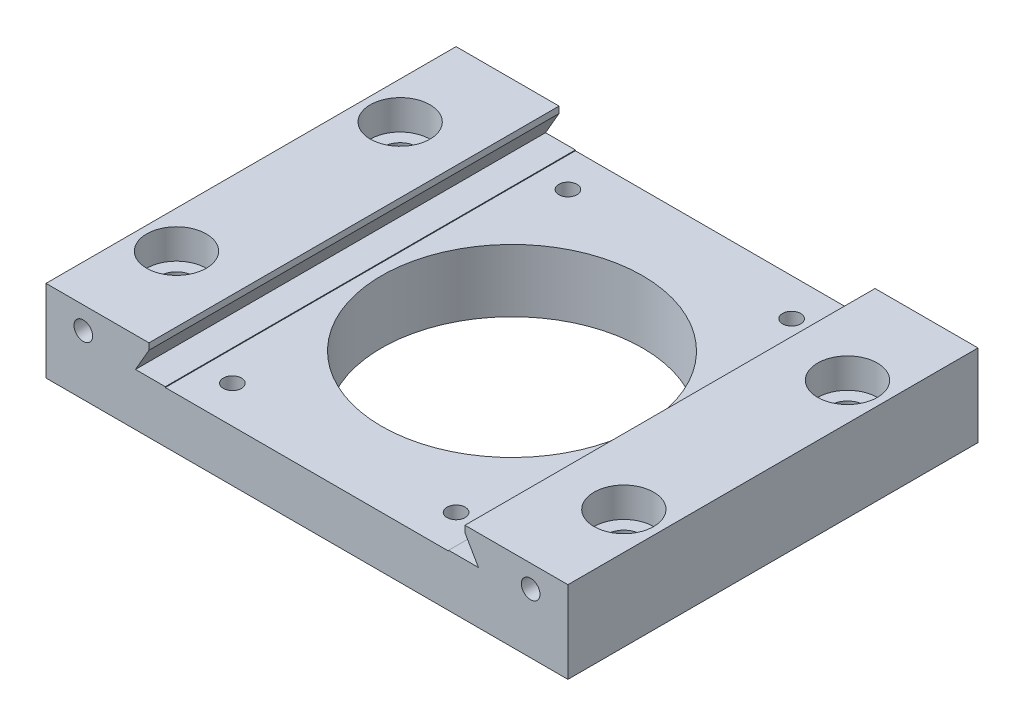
ISO-10303-21;
HEADER;
FILE_DESCRIPTION(('STEP AP214'),'2;1');
FILE_NAME('part.step','',(''),(''),'','','');
FILE_SCHEMA(('AUTOMOTIVE_DESIGN { 1 0 10303 214 1 1 1 1 }'));
ENDSEC;
DATA;
#1=APPLICATION_CONTEXT('core data for automotive mechanical design processes');
#2=APPLICATION_PROTOCOL_DEFINITION('international standard','automotive_design',2000,#1);
#3=PRODUCT_CONTEXT('',#1,'mechanical');
#4=PRODUCT('Part','Part','',(#3));
#5=PRODUCT_RELATED_PRODUCT_CATEGORY('part','',(#4));
#6=PRODUCT_DEFINITION_FORMATION('','',#4);
#7=PRODUCT_DEFINITION_CONTEXT('part definition',#1,'design');
#8=PRODUCT_DEFINITION('design','',#6,#7);
#9=PRODUCT_DEFINITION_SHAPE('','',#8);
#10=(LENGTH_UNIT() NAMED_UNIT(*) SI_UNIT(.MILLI.,.METRE.));
#11=(NAMED_UNIT(*) PLANE_ANGLE_UNIT() SI_UNIT($,.RADIAN.));
#12=(NAMED_UNIT(*) SI_UNIT($,.STERADIAN.) SOLID_ANGLE_UNIT());
#13=UNCERTAINTY_MEASURE_WITH_UNIT(LENGTH_MEASURE(1.E-05),#10,'distance_accuracy_value','');
#14=(GEOMETRIC_REPRESENTATION_CONTEXT(3) GLOBAL_UNCERTAINTY_ASSIGNED_CONTEXT((#13)) GLOBAL_UNIT_ASSIGNED_CONTEXT((#10,
#11,#12)) REPRESENTATION_CONTEXT('',''));
#15=CARTESIAN_POINT('',(0.,0.,0.));
#16=DIRECTION('',(0.,0.,1.));
#17=DIRECTION('',(1.,0.,0.));
#18=AXIS2_PLACEMENT_3D('',#15,#16,#17);
#19=CARTESIAN_POINT('',(35.,11.,-27.5));
#20=DIRECTION('',(0.,-1.,0.));
#21=DIRECTION('',(0.,0.,-1.));
#22=AXIS2_PLACEMENT_3D('',#19,#20,#21);
#23=PLANE('',#22);
#24=CARTESIAN_POINT('',(30.,11.,15.));
#25=DIRECTION('',(0.,1.,0.));
#26=DIRECTION('',(0.,0.,1.));
#27=AXIS2_PLACEMENT_3D('',#24,#25,#26);
#28=CIRCLE('',#27,3.99999999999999);
#29=CARTESIAN_POINT('',(30.,11.,19.));
#30=VERTEX_POINT('',#29);
#31=EDGE_CURVE('E318',#30,#30,#28,.T.);
#32=ORIENTED_EDGE('',*,*,#31,.F.);
#33=EDGE_LOOP('',(#32));
#34=FACE_BOUND('',#33,.T.);
#35=CARTESIAN_POINT('',(30.,11.,-15.));
#36=DIRECTION('',(0.,1.,0.));
#37=DIRECTION('',(0.,0.,1.));
#38=AXIS2_PLACEMENT_3D('',#35,#36,#37);
#39=CIRCLE('',#38,3.99999999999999);
#40=CARTESIAN_POINT('',(30.,11.,-11.));
#41=VERTEX_POINT('',#40);
#42=EDGE_CURVE('E308',#41,#41,#39,.T.);
#43=ORIENTED_EDGE('',*,*,#42,.F.);
#44=EDGE_LOOP('',(#43));
#45=FACE_BOUND('',#44,.T.);
#46=DIRECTION('',(0.,0.,1.));
#47=VECTOR('',#46,1.);
#48=CARTESIAN_POINT('',(21.1905989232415,11.,-27.5));
#49=LINE('',#48,#47);
#50=CARTESIAN_POINT('',(21.1905989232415,11.,-27.5));
#51=VERTEX_POINT('',#50);
#52=CARTESIAN_POINT('',(21.1905989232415,11.,27.5));
#53=VERTEX_POINT('',#52);
#54=EDGE_CURVE('E277',#51,#53,#49,.T.);
#55=ORIENTED_EDGE('',*,*,#54,.T.);
#56=DIRECTION('',(-1.,0.,0.));
#57=VECTOR('',#56,1.);
#58=CARTESIAN_POINT('',(35.,11.,27.5));
#59=LINE('',#58,#57);
#60=CARTESIAN_POINT('',(35.,11.,27.5));
#61=VERTEX_POINT('',#60);
#62=EDGE_CURVE('E588',#61,#53,#59,.T.);
#63=ORIENTED_EDGE('',*,*,#62,.F.);
#64=DIRECTION('',(0.,0.,1.));
#65=VECTOR('',#64,1.);
#66=CARTESIAN_POINT('',(35.,11.,-27.5));
#67=LINE('',#66,#65);
#68=CARTESIAN_POINT('',(35.,11.,-27.5));
#69=VERTEX_POINT('',#68);
#70=EDGE_CURVE('E571',#69,#61,#67,.T.);
#71=ORIENTED_EDGE('',*,*,#70,.F.);
#72=DIRECTION('',(-1.,0.,0.));
#73=VECTOR('',#72,1.);
#74=CARTESIAN_POINT('',(35.,11.,-27.5));
#75=LINE('',#74,#73);
#76=EDGE_CURVE('E592',#69,#51,#75,.T.);
#77=ORIENTED_EDGE('',*,*,#76,.T.);
#78=EDGE_LOOP('',(#55,#63,#71,#77));
#79=FACE_BOUND('',#78,.T.);
#80=ADVANCED_FACE('F36',(#34,#45,#79),#23,.F.);
#81=CARTESIAN_POINT('',(35.,0.,-27.5));
#82=DIRECTION('',(0.,0.,1.));
#83=DIRECTION('',(1.,0.,0.));
#84=AXIS2_PLACEMENT_3D('',#81,#82,#83);
#85=PLANE('',#84);
#86=DIRECTION('',(0.,-1.,0.));
#87=VECTOR('',#86,1.);
#88=CARTESIAN_POINT('',(21.1905989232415,11.,-27.5));
#89=LINE('',#88,#87);
#90=CARTESIAN_POINT('',(21.1905989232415,10.1339745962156,-27.5));
#91=VERTEX_POINT('',#90);
#92=EDGE_CURVE('E53',#51,#91,#89,.T.);
#93=ORIENTED_EDGE('',*,*,#92,.F.);
#94=ORIENTED_EDGE('',*,*,#76,.F.);
#95=DIRECTION('',(0.,1.,0.));
#96=VECTOR('',#95,1.);
#97=CARTESIAN_POINT('',(35.,0.,-27.5));
#98=LINE('',#97,#96);
#99=CARTESIAN_POINT('',(35.,0.,-27.5));
#100=VERTEX_POINT('',#99);
#101=EDGE_CURVE('E568',#100,#69,#98,.T.);
#102=ORIENTED_EDGE('',*,*,#101,.F.);
#103=DIRECTION('',(-1.,0.,0.));
#104=VECTOR('',#103,1.);
#105=CARTESIAN_POINT('',(35.,0.,-27.5));
#106=LINE('',#105,#104);
#107=CARTESIAN_POINT('',(-35.,0.,-27.5));
#108=VERTEX_POINT('',#107);
#109=EDGE_CURVE('E45',#100,#108,#106,.T.);
#110=ORIENTED_EDGE('',*,*,#109,.T.);
#111=DIRECTION('',(0.,1.,0.));
#112=VECTOR('',#111,1.);
#113=CARTESIAN_POINT('',(-35.,0.,-27.5));
#114=LINE('',#113,#112);
#115=CARTESIAN_POINT('',(-35.,11.,-27.5));
#116=VERTEX_POINT('',#115);
#117=EDGE_CURVE('E577',#108,#116,#114,.T.);
#118=ORIENTED_EDGE('',*,*,#117,.T.);
#119=CARTESIAN_POINT('',(-21.1905989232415,11.,-27.5));
#120=VERTEX_POINT('',#119);
#121=EDGE_CURVE('E591',#120,#116,#75,.T.);
#122=ORIENTED_EDGE('',*,*,#121,.F.);
#123=DIRECTION('',(0.,-1.,0.));
#124=VECTOR('',#123,1.);
#125=CARTESIAN_POINT('',(-21.1905989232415,11.,-27.5));
#126=LINE('',#125,#124);
#127=CARTESIAN_POINT('',(-21.1905989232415,10.1339745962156,-27.5));
#128=VERTEX_POINT('',#127);
#129=EDGE_CURVE('E281',#120,#128,#126,.T.);
#130=ORIENTED_EDGE('',*,*,#129,.T.);
#131=DIRECTION('',(-0.500000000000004,-0.866025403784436,0.));
#132=VECTOR('',#131,1.);
#133=CARTESIAN_POINT('',(-20.6905989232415,11.,-27.5));
#134=LINE('',#133,#132);
#135=CARTESIAN_POINT('',(-23.,6.99999999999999,-27.5));
#136=VERTEX_POINT('',#135);
#137=EDGE_CURVE('E542',#128,#136,#134,.T.);
#138=ORIENTED_EDGE('',*,*,#137,.T.);
#139=DIRECTION('',(1.,0.,0.));
#140=VECTOR('',#139,1.);
#141=CARTESIAN_POINT('',(-23.,6.99999999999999,-27.5));
#142=LINE('',#141,#140);
#143=CARTESIAN_POINT('',(-19.,6.99999999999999,-27.5));
#144=VERTEX_POINT('',#143);
#145=EDGE_CURVE('E546',#136,#144,#142,.T.);
#146=ORIENTED_EDGE('',*,*,#145,.T.);
#147=DIRECTION('',(0.,1.,0.));
#148=VECTOR('',#147,1.);
#149=CARTESIAN_POINT('',(-19.,6.89999999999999,-27.5));
#150=LINE('',#149,#148);
#151=CARTESIAN_POINT('',(-19.,6.89999999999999,-27.5));
#152=VERTEX_POINT('',#151);
#153=EDGE_CURVE('E538',#152,#144,#150,.T.);
#154=ORIENTED_EDGE('',*,*,#153,.F.);
#155=DIRECTION('',(-1.,0.,0.));
#156=VECTOR('',#155,1.);
#157=CARTESIAN_POINT('',(-19.,6.89999999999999,-27.5));
#158=LINE('',#157,#156);
#159=CARTESIAN_POINT('',(19.,6.89999999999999,-27.5));
#160=VERTEX_POINT('',#159);
#161=EDGE_CURVE('E519',#160,#152,#158,.T.);
#162=ORIENTED_EDGE('',*,*,#161,.F.);
#163=DIRECTION('',(0.,1.,0.));
#164=VECTOR('',#163,1.);
#165=CARTESIAN_POINT('',(19.,6.89999999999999,-27.5));
#166=LINE('',#165,#164);
#167=CARTESIAN_POINT('',(19.,6.99999999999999,-27.5));
#168=VERTEX_POINT('',#167);
#169=EDGE_CURVE('E529',#160,#168,#166,.T.);
#170=ORIENTED_EDGE('',*,*,#169,.T.);
#171=CARTESIAN_POINT('',(23.,6.99999999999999,-27.5));
#172=VERTEX_POINT('',#171);
#173=EDGE_CURVE('E544',#168,#172,#142,.T.);
#174=ORIENTED_EDGE('',*,*,#173,.T.);
#175=DIRECTION('',(-0.500000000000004,0.866025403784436,0.));
#176=VECTOR('',#175,1.);
#177=CARTESIAN_POINT('',(23.,6.99999999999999,-27.5));
#178=LINE('',#177,#176);
#179=EDGE_CURVE('E549',#172,#91,#178,.T.);
#180=ORIENTED_EDGE('',*,*,#179,.T.);
#181=EDGE_LOOP('',(#93,#94,#102,#110,#118,#122,#130,#138,#146,#154,#162,#170,#174,#180));
#182=FACE_BOUND('',#181,.T.);
#183=ADVANCED_FACE('F630',(#182),#85,.F.);
#184=CARTESIAN_POINT('',(35.,11.,27.5));
#185=DIRECTION('',(0.,0.,-1.));
#186=DIRECTION('',(-1.,0.,0.));
#187=AXIS2_PLACEMENT_3D('',#184,#185,#186);
#188=PLANE('',#187);
#189=CARTESIAN_POINT('',(-30.,8.,27.5));
#190=DIRECTION('',(0.,0.,1.));
#191=DIRECTION('',(1.,0.,0.));
#192=AXIS2_PLACEMENT_3D('',#189,#190,#191);
#193=CIRCLE('',#192,1.25);
#194=CARTESIAN_POINT('',(-28.75,8.,27.5));
#195=VERTEX_POINT('',#194);
#196=EDGE_CURVE('E262',#195,#195,#193,.T.);
#197=ORIENTED_EDGE('',*,*,#196,.F.);
#198=EDGE_LOOP('',(#197));
#199=FACE_BOUND('',#198,.T.);
#200=CARTESIAN_POINT('',(30.,8.,27.5));
#201=DIRECTION('',(0.,0.,1.));
#202=DIRECTION('',(1.,0.,0.));
#203=AXIS2_PLACEMENT_3D('',#200,#201,#202);
#204=CIRCLE('',#203,1.25);
#205=CARTESIAN_POINT('',(31.25,8.,27.5));
#206=VERTEX_POINT('',#205);
#207=EDGE_CURVE('E261',#206,#206,#204,.T.);
#208=ORIENTED_EDGE('',*,*,#207,.F.);
#209=EDGE_LOOP('',(#208));
#210=FACE_BOUND('',#209,.T.);
#211=DIRECTION('',(0.,-1.,0.));
#212=VECTOR('',#211,1.);
#213=CARTESIAN_POINT('',(21.1905989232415,11.,27.5));
#214=LINE('',#213,#212);
#215=CARTESIAN_POINT('',(21.1905989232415,10.1339745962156,27.5));
#216=VERTEX_POINT('',#215);
#217=EDGE_CURVE('E272',#53,#216,#214,.T.);
#218=ORIENTED_EDGE('',*,*,#217,.T.);
#219=DIRECTION('',(-0.500000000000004,0.866025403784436,0.));
#220=VECTOR('',#219,1.);
#221=CARTESIAN_POINT('',(23.,6.99999999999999,27.5));
#222=LINE('',#221,#220);
#223=CARTESIAN_POINT('',(23.,6.99999999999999,27.5));
#224=VERTEX_POINT('',#223);
#225=EDGE_CURVE('E545',#224,#216,#222,.T.);
#226=ORIENTED_EDGE('',*,*,#225,.F.);
#227=DIRECTION('',(1.,0.,0.));
#228=VECTOR('',#227,1.);
#229=CARTESIAN_POINT('',(0.,6.99999999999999,27.5));
#230=LINE('',#229,#228);
#231=CARTESIAN_POINT('',(19.,6.99999999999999,27.5));
#232=VERTEX_POINT('',#231);
#233=EDGE_CURVE('E554',#232,#224,#230,.T.);
#234=ORIENTED_EDGE('',*,*,#233,.F.);
#235=DIRECTION('',(0.,1.,0.));
#236=VECTOR('',#235,1.);
#237=CARTESIAN_POINT('',(19.,6.89999999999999,27.5));
#238=LINE('',#237,#236);
#239=CARTESIAN_POINT('',(19.,6.89999999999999,27.5));
#240=VERTEX_POINT('',#239);
#241=EDGE_CURVE('E532',#240,#232,#238,.T.);
#242=ORIENTED_EDGE('',*,*,#241,.F.);
#243=DIRECTION('',(1.,0.,0.));
#244=VECTOR('',#243,1.);
#245=CARTESIAN_POINT('',(-19.,6.89999999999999,27.5));
#246=LINE('',#245,#244);
#247=CARTESIAN_POINT('',(-19.,6.89999999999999,27.5));
#248=VERTEX_POINT('',#247);
#249=EDGE_CURVE('E526',#248,#240,#246,.T.);
#250=ORIENTED_EDGE('',*,*,#249,.F.);
#251=DIRECTION('',(0.,1.,0.));
#252=VECTOR('',#251,1.);
#253=CARTESIAN_POINT('',(-19.,6.89999999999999,27.5));
#254=LINE('',#253,#252);
#255=CARTESIAN_POINT('',(-19.,6.99999999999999,27.5));
#256=VERTEX_POINT('',#255);
#257=EDGE_CURVE('E535',#248,#256,#254,.T.);
#258=ORIENTED_EDGE('',*,*,#257,.T.);
#259=CARTESIAN_POINT('',(-23.,6.99999999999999,27.5));
#260=VERTEX_POINT('',#259);
#261=EDGE_CURVE('E555',#260,#256,#230,.T.);
#262=ORIENTED_EDGE('',*,*,#261,.F.);
#263=DIRECTION('',(-0.500000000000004,-0.866025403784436,0.));
#264=VECTOR('',#263,1.);
#265=CARTESIAN_POINT('',(-20.6905989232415,11.,27.5));
#266=LINE('',#265,#264);
#267=CARTESIAN_POINT('',(-21.1905989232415,10.1339745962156,27.5));
#268=VERTEX_POINT('',#267);
#269=EDGE_CURVE('E534',#268,#260,#266,.T.);
#270=ORIENTED_EDGE('',*,*,#269,.F.);
#271=DIRECTION('',(0.,-1.,0.));
#272=VECTOR('',#271,1.);
#273=CARTESIAN_POINT('',(-21.1905989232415,11.,27.5));
#274=LINE('',#273,#272);
#275=CARTESIAN_POINT('',(-21.1905989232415,11.,27.5));
#276=VERTEX_POINT('',#275);
#277=EDGE_CURVE('E61',#276,#268,#274,.T.);
#278=ORIENTED_EDGE('',*,*,#277,.F.);
#279=CARTESIAN_POINT('',(-35.,11.,27.5));
#280=VERTEX_POINT('',#279);
#281=EDGE_CURVE('E587',#276,#280,#59,.T.);
#282=ORIENTED_EDGE('',*,*,#281,.T.);
#283=DIRECTION('',(0.,-1.,0.));
#284=VECTOR('',#283,1.);
#285=CARTESIAN_POINT('',(-35.,11.,27.5));
#286=LINE('',#285,#284);
#287=CARTESIAN_POINT('',(-35.,0.,27.5));
#288=VERTEX_POINT('',#287);
#289=EDGE_CURVE('E569',#280,#288,#286,.T.);
#290=ORIENTED_EDGE('',*,*,#289,.T.);
#291=DIRECTION('',(-1.,0.,0.));
#292=VECTOR('',#291,1.);
#293=CARTESIAN_POINT('',(35.,0.,27.5));
#294=LINE('',#293,#292);
#295=CARTESIAN_POINT('',(35.,0.,27.5));
#296=VERTEX_POINT('',#295);
#297=EDGE_CURVE('E575',#296,#288,#294,.T.);
#298=ORIENTED_EDGE('',*,*,#297,.F.);
#299=DIRECTION('',(0.,-1.,0.));
#300=VECTOR('',#299,1.);
#301=CARTESIAN_POINT('',(35.,11.,27.5));
#302=LINE('',#301,#300);
#303=EDGE_CURVE('E573',#61,#296,#302,.T.);
#304=ORIENTED_EDGE('',*,*,#303,.F.);
#305=ORIENTED_EDGE('',*,*,#62,.T.);
#306=EDGE_LOOP('',(#218,#226,#234,#242,#250,#258,#262,#270,#278,#282,#290,#298,#304,#305));
#307=FACE_BOUND('',#306,.T.);
#308=ADVANCED_FACE('F637',(#199,#210,#307),#188,.F.);
#309=CARTESIAN_POINT('',(23.,6.99999999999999,-27.5));
#310=DIRECTION('',(0.866025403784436,0.500000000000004,0.));
#311=DIRECTION('',(-0.500000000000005,0.866025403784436,0.));
#312=AXIS2_PLACEMENT_3D('',#309,#310,#311);
#313=PLANE('',#312);
#314=DIRECTION('',(0.,0.,1.));
#315=VECTOR('',#314,1.);
#316=CARTESIAN_POINT('',(21.1905989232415,10.1339745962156,-27.5));
#317=LINE('',#316,#315);
#318=EDGE_CURVE('E274',#91,#216,#317,.T.);
#319=ORIENTED_EDGE('',*,*,#318,.F.);
#320=ORIENTED_EDGE('',*,*,#179,.F.);
#321=DIRECTION('',(0.,0.,1.));
#322=VECTOR('',#321,1.);
#323=CARTESIAN_POINT('',(23.,6.99999999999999,-27.5));
#324=LINE('',#323,#322);
#325=EDGE_CURVE('E560',#172,#224,#324,.T.);
#326=ORIENTED_EDGE('',*,*,#325,.T.);
#327=ORIENTED_EDGE('',*,*,#225,.T.);
#328=EDGE_LOOP('',(#319,#320,#326,#327));
#329=FACE_BOUND('',#328,.T.);
#330=ADVANCED_FACE('F763',(#329),#313,.F.);
#331=CARTESIAN_POINT('',(35.,0.,0.));
#332=DIRECTION('',(0.,1.,0.));
#333=DIRECTION('',(0.,0.,1.));
#334=AXIS2_PLACEMENT_3D('',#331,#332,#333);
#335=PLANE('',#334);
#336=CARTESIAN_POINT('',(-30.,0.,-15.));
#337=DIRECTION('',(0.,1.,0.));
#338=DIRECTION('',(0.,0.,1.));
#339=AXIS2_PLACEMENT_3D('',#336,#337,#338);
#340=CIRCLE('',#339,2.25);
#341=CARTESIAN_POINT('',(-30.,0.,-12.75));
#342=VERTEX_POINT('',#341);
#343=EDGE_CURVE('E40',#342,#342,#340,.T.);
#344=ORIENTED_EDGE('',*,*,#343,.T.);
#345=EDGE_LOOP('',(#344));
#346=FACE_BOUND('',#345,.T.);
#347=CARTESIAN_POINT('',(-30.,0.,15.));
#348=DIRECTION('',(0.,1.,0.));
#349=DIRECTION('',(0.,0.,1.));
#350=AXIS2_PLACEMENT_3D('',#347,#348,#349);
#351=CIRCLE('',#350,2.25);
#352=CARTESIAN_POINT('',(-30.,0.,17.25));
#353=VERTEX_POINT('',#352);
#354=EDGE_CURVE('E307',#353,#353,#351,.T.);
#355=ORIENTED_EDGE('',*,*,#354,.T.);
#356=EDGE_LOOP('',(#355));
#357=FACE_BOUND('',#356,.T.);
#358=CARTESIAN_POINT('',(30.,0.,-15.));
#359=DIRECTION('',(0.,1.,0.));
#360=DIRECTION('',(0.,0.,1.));
#361=AXIS2_PLACEMENT_3D('',#358,#359,#360);
#362=CIRCLE('',#361,2.25);
#363=CARTESIAN_POINT('',(30.,0.,-12.75));
#364=VERTEX_POINT('',#363);
#365=EDGE_CURVE('E317',#364,#364,#362,.T.);
#366=ORIENTED_EDGE('',*,*,#365,.T.);
#367=EDGE_LOOP('',(#366));
#368=FACE_BOUND('',#367,.T.);
#369=CARTESIAN_POINT('',(30.,0.,15.));
#370=DIRECTION('',(0.,1.,0.));
#371=DIRECTION('',(0.,0.,1.));
#372=AXIS2_PLACEMENT_3D('',#369,#370,#371);
#373=CIRCLE('',#372,2.25);
#374=CARTESIAN_POINT('',(30.,0.,17.25));
#375=VERTEX_POINT('',#374);
#376=EDGE_CURVE('E327',#375,#375,#373,.T.);
#377=ORIENTED_EDGE('',*,*,#376,.T.);
#378=EDGE_LOOP('',(#377));
#379=FACE_BOUND('',#378,.T.);
#380=CARTESIAN_POINT('',(13.,0.,22.5));
#381=DIRECTION('',(0.,1.,0.));
#382=DIRECTION('',(0.,0.,-1.));
#383=AXIS2_PLACEMENT_3D('',#380,#381,#382);
#384=CIRCLE('',#383,3.);
#385=CARTESIAN_POINT('',(13.,0.,19.5));
#386=VERTEX_POINT('',#385);
#387=CARTESIAN_POINT('',(13.,0.,25.5));
#388=VERTEX_POINT('',#387);
#389=EDGE_CURVE('E389',#386,#388,#384,.T.);
#390=ORIENTED_EDGE('',*,*,#389,.T.);
#391=DIRECTION('',(1.,0.,0.));
#392=VECTOR('',#391,1.);
#393=CARTESIAN_POINT('',(13.,0.,25.5));
#394=LINE('',#393,#392);
#395=CARTESIAN_POINT('',(26.,0.,25.5));
#396=VERTEX_POINT('',#395);
#397=EDGE_CURVE('E400',#388,#396,#394,.T.);
#398=ORIENTED_EDGE('',*,*,#397,.T.);
#399=CARTESIAN_POINT('',(26.,0.,22.5));
#400=DIRECTION('',(0.,1.,0.));
#401=DIRECTION('',(0.,0.,-1.));
#402=AXIS2_PLACEMENT_3D('',#399,#400,#401);
#403=CIRCLE('',#402,2.99999999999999);
#404=CARTESIAN_POINT('',(26.,0.,19.5));
#405=VERTEX_POINT('',#404);
#406=EDGE_CURVE('E412',#396,#405,#403,.T.);
#407=ORIENTED_EDGE('',*,*,#406,.T.);
#408=DIRECTION('',(-1.,0.,0.));
#409=VECTOR('',#408,1.);
#410=CARTESIAN_POINT('',(13.,0.,19.5));
#411=LINE('',#410,#409);
#412=EDGE_CURVE('E409',#405,#386,#411,.T.);
#413=ORIENTED_EDGE('',*,*,#412,.T.);
#414=EDGE_LOOP('',(#390,#398,#407,#413));
#415=FACE_BOUND('',#414,.T.);
#416=DIRECTION('',(0.,0.,-1.));
#417=VECTOR('',#416,1.);
#418=CARTESIAN_POINT('',(-35.,0.,0.));
#419=LINE('',#418,#417);
#420=EDGE_CURVE('E563',#288,#108,#419,.T.);
#421=ORIENTED_EDGE('',*,*,#420,.T.);
#422=ORIENTED_EDGE('',*,*,#109,.F.);
#423=DIRECTION('',(0.,0.,-1.));
#424=VECTOR('',#423,1.);
#425=CARTESIAN_POINT('',(35.,0.,27.5));
#426=LINE('',#425,#424);
#427=EDGE_CURVE('E566',#296,#100,#426,.T.);
#428=ORIENTED_EDGE('',*,*,#427,.F.);
#429=ORIENTED_EDGE('',*,*,#297,.T.);
#430=EDGE_LOOP('',(#421,#422,#428,#429));
#431=FACE_BOUND('',#430,.T.);
#432=DIRECTION('',(-1.,0.,0.));
#433=VECTOR('',#432,1.);
#434=CARTESIAN_POINT('',(-13.,0.,25.5));
#435=LINE('',#434,#433);
#436=CARTESIAN_POINT('',(-13.,0.,25.5));
#437=VERTEX_POINT('',#436);
#438=CARTESIAN_POINT('',(-26.,0.,25.5));
#439=VERTEX_POINT('',#438);
#440=EDGE_CURVE('E499',#437,#439,#435,.T.);
#441=ORIENTED_EDGE('',*,*,#440,.F.);
#442=CARTESIAN_POINT('',(-13.,0.,22.5));
#443=DIRECTION('',(0.,-1.,0.));
#444=DIRECTION('',(0.,0.,-1.));
#445=AXIS2_PLACEMENT_3D('',#442,#443,#444);
#446=CIRCLE('',#445,3.);
#447=CARTESIAN_POINT('',(-13.,0.,19.5));
#448=VERTEX_POINT('',#447);
#449=EDGE_CURVE('E483',#448,#437,#446,.T.);
#450=ORIENTED_EDGE('',*,*,#449,.F.);
#451=DIRECTION('',(1.,0.,0.));
#452=VECTOR('',#451,1.);
#453=CARTESIAN_POINT('',(-13.,0.,19.5));
#454=LINE('',#453,#452);
#455=CARTESIAN_POINT('',(-26.,0.,19.5));
#456=VERTEX_POINT('',#455);
#457=EDGE_CURVE('E488',#456,#448,#454,.T.);
#458=ORIENTED_EDGE('',*,*,#457,.F.);
#459=CARTESIAN_POINT('',(-26.,0.,22.5));
#460=DIRECTION('',(0.,-1.,0.));
#461=DIRECTION('',(0.,0.,-1.));
#462=AXIS2_PLACEMENT_3D('',#459,#460,#461);
#463=CIRCLE('',#462,2.99999999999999);
#464=EDGE_CURVE('E502',#439,#456,#463,.T.);
#465=ORIENTED_EDGE('',*,*,#464,.F.);
#466=EDGE_LOOP('',(#441,#450,#458,#465));
#467=FACE_BOUND('',#466,.T.);
#468=CARTESIAN_POINT('',(-13.,0.,-22.5));
#469=DIRECTION('',(0.,1.,0.));
#470=DIRECTION('',(0.,0.,1.));
#471=AXIS2_PLACEMENT_3D('',#468,#469,#470);
#472=CIRCLE('',#471,3.);
#473=CARTESIAN_POINT('',(-13.,0.,-19.5));
#474=VERTEX_POINT('',#473);
#475=CARTESIAN_POINT('',(-13.,0.,-25.5));
#476=VERTEX_POINT('',#475);
#477=EDGE_CURVE('E439',#474,#476,#472,.T.);
#478=ORIENTED_EDGE('',*,*,#477,.T.);
#479=DIRECTION('',(-1.,0.,0.));
#480=VECTOR('',#479,1.);
#481=CARTESIAN_POINT('',(-13.,0.,-25.5));
#482=LINE('',#481,#480);
#483=CARTESIAN_POINT('',(-26.,0.,-25.5));
#484=VERTEX_POINT('',#483);
#485=EDGE_CURVE('E444',#476,#484,#482,.T.);
#486=ORIENTED_EDGE('',*,*,#485,.T.);
#487=CARTESIAN_POINT('',(-26.,0.,-22.5));
#488=DIRECTION('',(0.,1.,0.));
#489=DIRECTION('',(0.,0.,1.));
#490=AXIS2_PLACEMENT_3D('',#487,#488,#489);
#491=CIRCLE('',#490,2.99999999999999);
#492=CARTESIAN_POINT('',(-26.,0.,-19.5));
#493=VERTEX_POINT('',#492);
#494=EDGE_CURVE('E456',#484,#493,#491,.T.);
#495=ORIENTED_EDGE('',*,*,#494,.T.);
#496=DIRECTION('',(1.,0.,0.));
#497=VECTOR('',#496,1.);
#498=CARTESIAN_POINT('',(-13.,0.,-19.5));
#499=LINE('',#498,#497);
#500=EDGE_CURVE('E453',#493,#474,#499,.T.);
#501=ORIENTED_EDGE('',*,*,#500,.T.);
#502=EDGE_LOOP('',(#478,#486,#495,#501));
#503=FACE_BOUND('',#502,.T.);
#504=DIRECTION('',(1.,0.,0.));
#505=VECTOR('',#504,1.);
#506=CARTESIAN_POINT('',(13.,0.,-25.5));
#507=LINE('',#506,#505);
#508=CARTESIAN_POINT('',(13.,0.,-25.5));
#509=VERTEX_POINT('',#508);
#510=CARTESIAN_POINT('',(26.,0.,-25.5));
#511=VERTEX_POINT('',#510);
#512=EDGE_CURVE('E379',#509,#511,#507,.T.);
#513=ORIENTED_EDGE('',*,*,#512,.F.);
#514=CARTESIAN_POINT('',(13.,0.,-22.5));
#515=DIRECTION('',(0.,-1.,0.));
#516=DIRECTION('',(0.,0.,1.));
#517=AXIS2_PLACEMENT_3D('',#514,#515,#516);
#518=CIRCLE('',#517,3.);
#519=CARTESIAN_POINT('',(13.,0.,-19.5));
#520=VERTEX_POINT('',#519);
#521=EDGE_CURVE('E363',#520,#509,#518,.T.);
#522=ORIENTED_EDGE('',*,*,#521,.F.);
#523=DIRECTION('',(-1.,0.,0.));
#524=VECTOR('',#523,1.);
#525=CARTESIAN_POINT('',(13.,0.,-19.5));
#526=LINE('',#525,#524);
#527=CARTESIAN_POINT('',(26.,0.,-19.5));
#528=VERTEX_POINT('',#527);
#529=EDGE_CURVE('E368',#528,#520,#526,.T.);
#530=ORIENTED_EDGE('',*,*,#529,.F.);
#531=CARTESIAN_POINT('',(26.,0.,-22.5));
#532=DIRECTION('',(0.,-1.,0.));
#533=DIRECTION('',(0.,0.,1.));
#534=AXIS2_PLACEMENT_3D('',#531,#532,#533);
#535=CIRCLE('',#534,2.99999999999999);
#536=EDGE_CURVE('E382',#511,#528,#535,.T.);
#537=ORIENTED_EDGE('',*,*,#536,.F.);
#538=EDGE_LOOP('',(#513,#522,#530,#537));
#539=FACE_BOUND('',#538,.T.);
#540=CARTESIAN_POINT('',(0.,0.,0.));
#541=DIRECTION('',(0.,1.,0.));
#542=DIRECTION('',(0.,0.,1.));
#543=AXIS2_PLACEMENT_3D('',#540,#541,#542);
#544=CIRCLE('',#543,19.5);
#545=CARTESIAN_POINT('',(0.,0.,19.5));
#546=VERTEX_POINT('',#545);
#547=EDGE_CURVE('E11',#546,#546,#544,.F.);
#548=ORIENTED_EDGE('',*,*,#547,.F.);
#549=EDGE_LOOP('',(#548));
#550=FACE_BOUND('',#549,.T.);
#551=ADVANCED_FACE('F38',(#346,#357,#368,#379,#415,#431,#467,#503,#539,#550),#335,.F.);
#552=CARTESIAN_POINT('',(0.,6.99999999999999,-27.5));
#553=DIRECTION('',(0.,-1.,0.));
#554=DIRECTION('',(0.,0.,-1.));
#555=AXIS2_PLACEMENT_3D('',#552,#553,#554);
#556=PLANE('',#555);
#557=ORIENTED_EDGE('',*,*,#173,.F.);
#558=DIRECTION('',(0.,0.,-1.));
#559=VECTOR('',#558,1.);
#560=CARTESIAN_POINT('',(19.,6.99999999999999,27.5));
#561=LINE('',#560,#559);
#562=EDGE_CURVE('E509',#232,#168,#561,.T.);
#563=ORIENTED_EDGE('',*,*,#562,.F.);
#564=ORIENTED_EDGE('',*,*,#233,.T.);
#565=ORIENTED_EDGE('',*,*,#325,.F.);
#566=EDGE_LOOP('',(#557,#563,#564,#565));
#567=FACE_BOUND('',#566,.T.);
#568=ADVANCED_FACE('F644',(#567),#556,.F.);
#569=CARTESIAN_POINT('',(-30.,11.,-15.));
#570=DIRECTION('',(0.,1.,0.));
#571=DIRECTION('',(0.,0.,1.));
#572=AXIS2_PLACEMENT_3D('',#569,#570,#571);
#573=CIRCLE('',#572,3.99999999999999);
#574=CARTESIAN_POINT('',(-30.,11.,-11.));
#575=VERTEX_POINT('',#574);
#576=EDGE_CURVE('E288',#575,#575,#573,.T.);
#577=ORIENTED_EDGE('',*,*,#576,.F.);
#578=EDGE_LOOP('',(#577));
#579=FACE_BOUND('',#578,.T.);
#580=CARTESIAN_POINT('',(-30.,11.,15.));
#581=DIRECTION('',(0.,1.,0.));
#582=DIRECTION('',(0.,0.,1.));
#583=AXIS2_PLACEMENT_3D('',#580,#581,#582);
#584=CIRCLE('',#583,3.99999999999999);
#585=CARTESIAN_POINT('',(-30.,11.,19.));
#586=VERTEX_POINT('',#585);
#587=EDGE_CURVE('E298',#586,#586,#584,.T.);
#588=ORIENTED_EDGE('',*,*,#587,.F.);
#589=EDGE_LOOP('',(#588));
#590=FACE_BOUND('',#589,.T.);
#591=ORIENTED_EDGE('',*,*,#281,.F.);
#592=DIRECTION('',(0.,0.,1.));
#593=VECTOR('',#592,1.);
#594=CARTESIAN_POINT('',(-21.1905989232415,11.,-27.5));
#595=LINE('',#594,#593);
#596=EDGE_CURVE('E284',#120,#276,#595,.T.);
#597=ORIENTED_EDGE('',*,*,#596,.F.);
#598=ORIENTED_EDGE('',*,*,#121,.T.);
#599=DIRECTION('',(0.,0.,1.));
#600=VECTOR('',#599,1.);
#601=CARTESIAN_POINT('',(-35.,11.,-27.5));
#602=LINE('',#601,#600);
#603=EDGE_CURVE('E580',#116,#280,#602,.T.);
#604=ORIENTED_EDGE('',*,*,#603,.T.);
#605=EDGE_LOOP('',(#591,#597,#598,#604));
#606=FACE_BOUND('',#605,.T.);
#607=ADVANCED_FACE('F633',(#579,#590,#606),#23,.F.);
#608=CARTESIAN_POINT('',(35.,0.,0.));
#609=DIRECTION('',(1.,0.,0.));
#610=DIRECTION('',(0.,0.,-1.));
#611=AXIS2_PLACEMENT_3D('',#608,#609,#610);
#612=PLANE('',#611);
#613=ORIENTED_EDGE('',*,*,#427,.T.);
#614=ORIENTED_EDGE('',*,*,#101,.T.);
#615=ORIENTED_EDGE('',*,*,#70,.T.);
#616=ORIENTED_EDGE('',*,*,#303,.T.);
#617=EDGE_LOOP('',(#613,#614,#615,#616));
#618=FACE_BOUND('',#617,.T.);
#619=ADVANCED_FACE('F643',(#618),#612,.T.);
#620=CARTESIAN_POINT('',(-35.,0.,0.));
#621=DIRECTION('',(1.,0.,0.));
#622=DIRECTION('',(0.,0.,-1.));
#623=AXIS2_PLACEMENT_3D('',#620,#621,#622);
#624=PLANE('',#623);
#625=ORIENTED_EDGE('',*,*,#420,.F.);
#626=ORIENTED_EDGE('',*,*,#289,.F.);
#627=ORIENTED_EDGE('',*,*,#603,.F.);
#628=ORIENTED_EDGE('',*,*,#117,.F.);
#629=EDGE_LOOP('',(#625,#626,#627,#628));
#630=FACE_BOUND('',#629,.T.);
#631=ADVANCED_FACE('F650',(#630),#624,.F.);
#632=ORIENTED_EDGE('',*,*,#261,.T.);
#633=DIRECTION('',(0.,0.,1.));
#634=VECTOR('',#633,1.);
#635=CARTESIAN_POINT('',(-19.,6.99999999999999,27.5));
#636=LINE('',#635,#634);
#637=EDGE_CURVE('E520',#144,#256,#636,.T.);
#638=ORIENTED_EDGE('',*,*,#637,.F.);
#639=ORIENTED_EDGE('',*,*,#145,.F.);
#640=DIRECTION('',(0.,0.,1.));
#641=VECTOR('',#640,1.);
#642=CARTESIAN_POINT('',(-23.,6.99999999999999,-27.5));
#643=LINE('',#642,#641);
#644=EDGE_CURVE('E552',#136,#260,#643,.T.);
#645=ORIENTED_EDGE('',*,*,#644,.T.);
#646=EDGE_LOOP('',(#632,#638,#639,#645));
#647=FACE_BOUND('',#646,.T.);
#648=ADVANCED_FACE('F655',(#647),#556,.F.);
#649=CARTESIAN_POINT('',(-20.6905989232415,11.,-27.5));
#650=DIRECTION('',(-0.866025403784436,0.500000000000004,0.));
#651=DIRECTION('',(-0.500000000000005,-0.866025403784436,0.));
#652=AXIS2_PLACEMENT_3D('',#649,#650,#651);
#653=PLANE('',#652);
#654=ORIENTED_EDGE('',*,*,#137,.F.);
#655=DIRECTION('',(0.,0.,1.));
#656=VECTOR('',#655,1.);
#657=CARTESIAN_POINT('',(-21.1905989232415,10.1339745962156,-27.5));
#658=LINE('',#657,#656);
#659=EDGE_CURVE('E286',#128,#268,#658,.T.);
#660=ORIENTED_EDGE('',*,*,#659,.T.);
#661=ORIENTED_EDGE('',*,*,#269,.T.);
#662=ORIENTED_EDGE('',*,*,#644,.F.);
#663=EDGE_LOOP('',(#654,#660,#661,#662));
#664=FACE_BOUND('',#663,.T.);
#665=ADVANCED_FACE('F672',(#664),#653,.F.);
#666=CARTESIAN_POINT('',(19.,6.89999999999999,27.5));
#667=DIRECTION('',(1.,0.,0.));
#668=DIRECTION('',(0.,0.,-1.));
#669=AXIS2_PLACEMENT_3D('',#666,#667,#668);
#670=PLANE('',#669);
#671=ORIENTED_EDGE('',*,*,#562,.T.);
#672=ORIENTED_EDGE('',*,*,#169,.F.);
#673=DIRECTION('',(0.,0.,-1.));
#674=VECTOR('',#673,1.);
#675=CARTESIAN_POINT('',(19.,6.89999999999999,27.5));
#676=LINE('',#675,#674);
#677=EDGE_CURVE('E516',#240,#160,#676,.T.);
#678=ORIENTED_EDGE('',*,*,#677,.F.);
#679=ORIENTED_EDGE('',*,*,#241,.T.);
#680=EDGE_LOOP('',(#671,#672,#678,#679));
#681=FACE_BOUND('',#680,.T.);
#682=ADVANCED_FACE('F736',(#681),#670,.F.);
#683=CARTESIAN_POINT('',(-19.,6.89999999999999,27.5));
#684=DIRECTION('',(-1.,0.,0.));
#685=DIRECTION('',(0.,0.,1.));
#686=AXIS2_PLACEMENT_3D('',#683,#684,#685);
#687=PLANE('',#686);
#688=ORIENTED_EDGE('',*,*,#637,.T.);
#689=ORIENTED_EDGE('',*,*,#257,.F.);
#690=DIRECTION('',(0.,0.,1.));
#691=VECTOR('',#690,1.);
#692=CARTESIAN_POINT('',(-19.,6.89999999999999,27.5));
#693=LINE('',#692,#691);
#694=EDGE_CURVE('E523',#152,#248,#693,.T.);
#695=ORIENTED_EDGE('',*,*,#694,.F.);
#696=ORIENTED_EDGE('',*,*,#153,.T.);
#697=EDGE_LOOP('',(#688,#689,#695,#696));
#698=FACE_BOUND('',#697,.T.);
#699=ADVANCED_FACE('F1148',(#698),#687,.F.);
#700=CARTESIAN_POINT('',(0.,6.89999999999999,0.));
#701=DIRECTION('',(0.,-1.,0.));
#702=DIRECTION('',(0.,0.,-1.));
#703=AXIS2_PLACEMENT_3D('',#700,#701,#702);
#704=PLANE('',#703);
#705=CARTESIAN_POINT('',(0.,6.89999999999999,0.));
#706=DIRECTION('',(0.,-1.,0.));
#707=DIRECTION('',(0.,0.,-1.));
#708=AXIS2_PLACEMENT_3D('',#705,#706,#707);
#709=CIRCLE('',#708,17.5);
#710=CARTESIAN_POINT('',(0.,6.89999999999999,-17.5));
#711=VERTEX_POINT('',#710);
#712=EDGE_CURVE('E331',#711,#711,#709,.T.);
#713=ORIENTED_EDGE('',*,*,#712,.T.);
#714=EDGE_LOOP('',(#713));
#715=FACE_BOUND('',#714,.T.);
#716=CARTESIAN_POINT('',(15.,6.89999999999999,22.5));
#717=DIRECTION('',(0.,-1.,0.));
#718=DIRECTION('',(0.,0.,-1.));
#719=AXIS2_PLACEMENT_3D('',#716,#717,#718);
#720=CIRCLE('',#719,1.21714410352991);
#721=CARTESIAN_POINT('',(15.,6.89999999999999,21.2828558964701));
#722=VERTEX_POINT('',#721);
#723=EDGE_CURVE('E343',#722,#722,#720,.T.);
#724=ORIENTED_EDGE('',*,*,#723,.T.);
#725=EDGE_LOOP('',(#724));
#726=FACE_BOUND('',#725,.T.);
#727=CARTESIAN_POINT('',(15.,6.89999999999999,-22.5));
#728=DIRECTION('',(0.,-1.,0.));
#729=DIRECTION('',(0.,0.,-1.));
#730=AXIS2_PLACEMENT_3D('',#727,#728,#729);
#731=CIRCLE('',#730,1.21714410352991);
#732=CARTESIAN_POINT('',(15.,6.89999999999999,-23.7171441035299));
#733=VERTEX_POINT('',#732);
#734=EDGE_CURVE('E356',#733,#733,#731,.T.);
#735=ORIENTED_EDGE('',*,*,#734,.T.);
#736=EDGE_LOOP('',(#735));
#737=FACE_BOUND('',#736,.T.);
#738=CARTESIAN_POINT('',(-15.,6.89999999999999,-22.5));
#739=DIRECTION('',(0.,-1.,0.));
#740=DIRECTION('',(0.,0.,-1.));
#741=AXIS2_PLACEMENT_3D('',#738,#739,#740);
#742=CIRCLE('',#741,1.21714410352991);
#743=CARTESIAN_POINT('',(-15.,6.89999999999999,-23.7171441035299));
#744=VERTEX_POINT('',#743);
#745=EDGE_CURVE('E432',#744,#744,#742,.T.);
#746=ORIENTED_EDGE('',*,*,#745,.T.);
#747=EDGE_LOOP('',(#746));
#748=FACE_BOUND('',#747,.T.);
#749=CARTESIAN_POINT('',(-15.,6.89999999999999,22.5));
#750=DIRECTION('',(0.,-1.,0.));
#751=DIRECTION('',(0.,0.,-1.));
#752=AXIS2_PLACEMENT_3D('',#749,#750,#751);
#753=CIRCLE('',#752,1.21714410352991);
#754=CARTESIAN_POINT('',(-15.,6.89999999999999,21.2828558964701));
#755=VERTEX_POINT('',#754);
#756=EDGE_CURVE('E476',#755,#755,#753,.T.);
#757=ORIENTED_EDGE('',*,*,#756,.T.);
#758=EDGE_LOOP('',(#757));
#759=FACE_BOUND('',#758,.T.);
#760=ORIENTED_EDGE('',*,*,#677,.T.);
#761=ORIENTED_EDGE('',*,*,#161,.T.);
#762=ORIENTED_EDGE('',*,*,#694,.T.);
#763=ORIENTED_EDGE('',*,*,#249,.T.);
#764=EDGE_LOOP('',(#760,#761,#762,#763));
#765=FACE_BOUND('',#764,.T.);
#766=ADVANCED_FACE('F1142',(#715,#726,#737,#748,#759,#765),#704,.F.);
#767=CARTESIAN_POINT('',(-13.,4.5,22.5));
#768=DIRECTION('',(0.,-1.,0.));
#769=DIRECTION('',(0.,0.,-1.));
#770=AXIS2_PLACEMENT_3D('',#767,#768,#769);
#771=CYLINDRICAL_SURFACE('',#770,3.);
#772=ORIENTED_EDGE('',*,*,#449,.T.);
#773=DIRECTION('',(0.,-1.,0.));
#774=VECTOR('',#773,1.);
#775=CARTESIAN_POINT('',(-13.,4.5,25.5));
#776=LINE('',#775,#774);
#777=CARTESIAN_POINT('',(-13.,4.5,25.5));
#778=VERTEX_POINT('',#777);
#779=EDGE_CURVE('E497',#778,#437,#776,.T.);
#780=ORIENTED_EDGE('',*,*,#779,.F.);
#781=CARTESIAN_POINT('',(-13.,4.5,22.5));
#782=DIRECTION('',(0.,-1.,0.));
#783=DIRECTION('',(0.,0.,-1.));
#784=AXIS2_PLACEMENT_3D('',#781,#782,#783);
#785=CIRCLE('',#784,3.);
#786=CARTESIAN_POINT('',(-13.,4.5,19.5));
#787=VERTEX_POINT('',#786);
#788=EDGE_CURVE('E484',#787,#778,#785,.T.);
#789=ORIENTED_EDGE('',*,*,#788,.F.);
#790=DIRECTION('',(0.,-1.,0.));
#791=VECTOR('',#790,1.);
#792=CARTESIAN_POINT('',(-13.,4.5,19.5));
#793=LINE('',#792,#791);
#794=EDGE_CURVE('E507',#787,#448,#793,.T.);
#795=ORIENTED_EDGE('',*,*,#794,.T.);
#796=EDGE_LOOP('',(#772,#780,#789,#795));
#797=FACE_BOUND('',#796,.T.);
#798=ADVANCED_FACE('F1147',(#797),#771,.F.);
#799=CARTESIAN_POINT('',(-13.,4.5,19.5));
#800=DIRECTION('',(0.,0.,-1.));
#801=DIRECTION('',(-1.,0.,0.));
#802=AXIS2_PLACEMENT_3D('',#799,#800,#801);
#803=PLANE('',#802);
#804=ORIENTED_EDGE('',*,*,#457,.T.);
#805=ORIENTED_EDGE('',*,*,#794,.F.);
#806=DIRECTION('',(1.,0.,0.));
#807=VECTOR('',#806,1.);
#808=CARTESIAN_POINT('',(-13.,4.5,19.5));
#809=LINE('',#808,#807);
#810=CARTESIAN_POINT('',(-26.,4.5,19.5));
#811=VERTEX_POINT('',#810);
#812=EDGE_CURVE('E494',#811,#787,#809,.T.);
#813=ORIENTED_EDGE('',*,*,#812,.F.);
#814=DIRECTION('',(0.,-1.,0.));
#815=VECTOR('',#814,1.);
#816=CARTESIAN_POINT('',(-26.,4.5,19.5));
#817=LINE('',#816,#815);
#818=EDGE_CURVE('E510',#811,#456,#817,.T.);
#819=ORIENTED_EDGE('',*,*,#818,.T.);
#820=EDGE_LOOP('',(#804,#805,#813,#819));
#821=FACE_BOUND('',#820,.T.);
#822=ADVANCED_FACE('F1258',(#821),#803,.F.);
#823=CARTESIAN_POINT('',(-26.,4.5,22.5));
#824=DIRECTION('',(0.,-1.,0.));
#825=DIRECTION('',(0.,0.,-1.));
#826=AXIS2_PLACEMENT_3D('',#823,#824,#825);
#827=CYLINDRICAL_SURFACE('',#826,2.99999999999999);
#828=ORIENTED_EDGE('',*,*,#464,.T.);
#829=ORIENTED_EDGE('',*,*,#818,.F.);
#830=CARTESIAN_POINT('',(-26.,4.5,22.5));
#831=DIRECTION('',(0.,-1.,0.));
#832=DIRECTION('',(0.,0.,-1.));
#833=AXIS2_PLACEMENT_3D('',#830,#831,#832);
#834=CIRCLE('',#833,2.99999999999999);
#835=CARTESIAN_POINT('',(-26.,4.5,25.5));
#836=VERTEX_POINT('',#835);
#837=EDGE_CURVE('E491',#836,#811,#834,.T.);
#838=ORIENTED_EDGE('',*,*,#837,.F.);
#839=DIRECTION('',(0.,-1.,0.));
#840=VECTOR('',#839,1.);
#841=CARTESIAN_POINT('',(-26.,4.5,25.5));
#842=LINE('',#841,#840);
#843=EDGE_CURVE('E512',#836,#439,#842,.T.);
#844=ORIENTED_EDGE('',*,*,#843,.T.);
#845=EDGE_LOOP('',(#828,#829,#838,#844));
#846=FACE_BOUND('',#845,.T.);
#847=ADVANCED_FACE('F1261',(#846),#827,.F.);
#848=CARTESIAN_POINT('',(-13.,4.5,25.5));
#849=DIRECTION('',(0.,0.,1.));
#850=DIRECTION('',(1.,0.,0.));
#851=AXIS2_PLACEMENT_3D('',#848,#849,#850);
#852=PLANE('',#851);
#853=ORIENTED_EDGE('',*,*,#440,.T.);
#854=ORIENTED_EDGE('',*,*,#843,.F.);
#855=DIRECTION('',(-1.,0.,0.));
#856=VECTOR('',#855,1.);
#857=CARTESIAN_POINT('',(-13.,4.5,25.5));
#858=LINE('',#857,#856);
#859=EDGE_CURVE('E487',#778,#836,#858,.T.);
#860=ORIENTED_EDGE('',*,*,#859,.F.);
#861=ORIENTED_EDGE('',*,*,#779,.T.);
#862=EDGE_LOOP('',(#853,#854,#860,#861));
#863=FACE_BOUND('',#862,.T.);
#864=ADVANCED_FACE('F1256',(#863),#852,.F.);
#865=CARTESIAN_POINT('',(-13.,4.5,22.5));
#866=DIRECTION('',(0.,-1.,0.));
#867=DIRECTION('',(0.,0.,-1.));
#868=AXIS2_PLACEMENT_3D('',#865,#866,#867);
#869=PLANE('',#868);
#870=CARTESIAN_POINT('',(-15.,4.5,22.5));
#871=DIRECTION('',(0.,-1.,0.));
#872=DIRECTION('',(0.,0.,-1.));
#873=AXIS2_PLACEMENT_3D('',#870,#871,#872);
#874=CIRCLE('',#873,1.54999999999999);
#875=CARTESIAN_POINT('',(-15.,4.5,20.95));
#876=VERTEX_POINT('',#875);
#877=EDGE_CURVE('E464',#876,#876,#874,.T.);
#878=ORIENTED_EDGE('',*,*,#877,.F.);
#879=EDGE_LOOP('',(#878));
#880=FACE_BOUND('',#879,.T.);
#881=CARTESIAN_POINT('',(-25.5,4.5,22.5));
#882=DIRECTION('',(0.,-1.,0.));
#883=DIRECTION('',(0.,0.,-1.));
#884=AXIS2_PLACEMENT_3D('',#881,#882,#883);
#885=CIRCLE('',#884,1.24999999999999);
#886=CARTESIAN_POINT('',(-25.5,4.5,21.25));
#887=VERTEX_POINT('',#886);
#888=EDGE_CURVE('E477',#887,#887,#885,.T.);
#889=ORIENTED_EDGE('',*,*,#888,.F.);
#890=EDGE_LOOP('',(#889));
#891=FACE_BOUND('',#890,.T.);
#892=ORIENTED_EDGE('',*,*,#788,.T.);
#893=ORIENTED_EDGE('',*,*,#859,.T.);
#894=ORIENTED_EDGE('',*,*,#837,.T.);
#895=ORIENTED_EDGE('',*,*,#812,.T.);
#896=EDGE_LOOP('',(#892,#893,#894,#895));
#897=FACE_BOUND('',#896,.T.);
#898=ADVANCED_FACE('F1253',(#880,#891,#897),#869,.T.);
#899=CARTESIAN_POINT('',(-25.5,9.,22.5));
#900=DIRECTION('',(0.,-1.,0.));
#901=DIRECTION('',(0.,0.,-1.));
#902=AXIS2_PLACEMENT_3D('',#899,#900,#901);
#903=CONICAL_SURFACE('',#902,1.25,1.02974425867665);
#904=CARTESIAN_POINT('',(-25.5,9.75107577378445,22.5));
#905=VERTEX_POINT('',#904);
#906=VERTEX_LOOP('',#905);
#907=FACE_BOUND('',#906,.T.);
#908=CARTESIAN_POINT('',(-25.5,9.,22.5));
#909=DIRECTION('',(0.,-1.,0.));
#910=DIRECTION('',(0.,0.,-1.));
#911=AXIS2_PLACEMENT_3D('',#908,#909,#910);
#912=CIRCLE('',#911,1.25);
#913=CARTESIAN_POINT('',(-25.5,9.,21.25));
#914=VERTEX_POINT('',#913);
#915=EDGE_CURVE('E480',#914,#914,#912,.T.);
#916=ORIENTED_EDGE('',*,*,#915,.T.);
#917=EDGE_LOOP('',(#916));
#918=FACE_BOUND('',#917,.T.);
#919=ADVANCED_FACE('F870',(#907,#918),#903,.F.);
#920=CARTESIAN_POINT('',(-25.5,4.5,22.5));
#921=DIRECTION('',(0.,-1.,0.));
#922=DIRECTION('',(0.,0.,-1.));
#923=AXIS2_PLACEMENT_3D('',#920,#921,#922);
#924=CYLINDRICAL_SURFACE('',#923,1.24999999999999);
#925=ORIENTED_EDGE('',*,*,#915,.F.);
#926=EDGE_LOOP('',(#925));
#927=FACE_BOUND('',#926,.T.);
#928=ORIENTED_EDGE('',*,*,#888,.T.);
#929=EDGE_LOOP('',(#928));
#930=FACE_BOUND('',#929,.T.);
#931=ADVANCED_FACE('F866',(#927,#930),#924,.F.);
#932=CARTESIAN_POINT('',(-15.,6.7,22.5));
#933=DIRECTION('',(0.,-1.,0.));
#934=DIRECTION('',(0.,0.,-1.));
#935=AXIS2_PLACEMENT_3D('',#932,#933,#934);
#936=CONICAL_SURFACE('',#935,1.55,1.02974425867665);
#937=CARTESIAN_POINT('',(-15.,6.7,22.5));
#938=DIRECTION('',(0.,-1.,0.));
#939=DIRECTION('',(0.,0.,-1.));
#940=AXIS2_PLACEMENT_3D('',#937,#938,#939);
#941=CIRCLE('',#940,1.55);
#942=CARTESIAN_POINT('',(-15.,6.7,20.95));
#943=VERTEX_POINT('',#942);
#944=EDGE_CURVE('E473',#943,#943,#941,.T.);
#945=ORIENTED_EDGE('',*,*,#944,.T.);
#946=EDGE_LOOP('',(#945));
#947=FACE_BOUND('',#946,.T.);
#948=ORIENTED_EDGE('',*,*,#756,.F.);
#949=EDGE_LOOP('',(#948));
#950=FACE_BOUND('',#949,.T.);
#951=ADVANCED_FACE('F869',(#947,#950),#936,.F.);
#952=CARTESIAN_POINT('',(-15.,4.5,22.5));
#953=DIRECTION('',(0.,-1.,0.));
#954=DIRECTION('',(0.,0.,-1.));
#955=AXIS2_PLACEMENT_3D('',#952,#953,#954);
#956=CYLINDRICAL_SURFACE('',#955,1.54999999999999);
#957=ORIENTED_EDGE('',*,*,#944,.F.);
#958=EDGE_LOOP('',(#957));
#959=FACE_BOUND('',#958,.T.);
#960=ORIENTED_EDGE('',*,*,#877,.T.);
#961=EDGE_LOOP('',(#960));
#962=FACE_BOUND('',#961,.T.);
#963=ADVANCED_FACE('F884',(#959,#962),#956,.F.);
#964=CARTESIAN_POINT('',(-13.,4.5,-22.5));
#965=DIRECTION('',(0.,-1.,0.));
#966=DIRECTION('',(0.,0.,-1.));
#967=AXIS2_PLACEMENT_3D('',#964,#965,#966);
#968=CYLINDRICAL_SURFACE('',#967,3.);
#969=ORIENTED_EDGE('',*,*,#477,.F.);
#970=DIRECTION('',(0.,-1.,0.));
#971=VECTOR('',#970,1.);
#972=CARTESIAN_POINT('',(-13.,4.5,-19.5));
#973=LINE('',#972,#971);
#974=CARTESIAN_POINT('',(-13.,4.5,-19.5));
#975=VERTEX_POINT('',#974);
#976=EDGE_CURVE('E450',#975,#474,#973,.T.);
#977=ORIENTED_EDGE('',*,*,#976,.F.);
#978=CARTESIAN_POINT('',(-13.,4.5,-22.5));
#979=DIRECTION('',(0.,1.,0.));
#980=DIRECTION('',(0.,0.,1.));
#981=AXIS2_PLACEMENT_3D('',#978,#979,#980);
#982=CIRCLE('',#981,3.);
#983=CARTESIAN_POINT('',(-13.,4.5,-25.5));
#984=VERTEX_POINT('',#983);
#985=EDGE_CURVE('E440',#975,#984,#982,.T.);
#986=ORIENTED_EDGE('',*,*,#985,.T.);
#987=DIRECTION('',(0.,-1.,0.));
#988=VECTOR('',#987,1.);
#989=CARTESIAN_POINT('',(-13.,4.5,-25.5));
#990=LINE('',#989,#988);
#991=EDGE_CURVE('E461',#984,#476,#990,.T.);
#992=ORIENTED_EDGE('',*,*,#991,.T.);
#993=EDGE_LOOP('',(#969,#977,#986,#992));
#994=FACE_BOUND('',#993,.T.);
#995=ADVANCED_FACE('F893',(#994),#968,.F.);
#996=CARTESIAN_POINT('',(-13.,4.5,-25.5));
#997=DIRECTION('',(0.,0.,1.));
#998=DIRECTION('',(1.,0.,0.));
#999=AXIS2_PLACEMENT_3D('',#996,#997,#998);
#1000=PLANE('',#999);
#1001=ORIENTED_EDGE('',*,*,#485,.F.);
#1002=ORIENTED_EDGE('',*,*,#991,.F.);
#1003=DIRECTION('',(-1.,0.,0.));
#1004=VECTOR('',#1003,1.);
#1005=CARTESIAN_POINT('',(-13.,4.5,-25.5));
#1006=LINE('',#1005,#1004);
#1007=CARTESIAN_POINT('',(-26.,4.5,-25.5));
#1008=VERTEX_POINT('',#1007);
#1009=EDGE_CURVE('E448',#984,#1008,#1006,.T.);
#1010=ORIENTED_EDGE('',*,*,#1009,.T.);
#1011=DIRECTION('',(0.,-1.,0.));
#1012=VECTOR('',#1011,1.);
#1013=CARTESIAN_POINT('',(-26.,4.5,-25.5));
#1014=LINE('',#1013,#1012);
#1015=EDGE_CURVE('E465',#1008,#484,#1014,.T.);
#1016=ORIENTED_EDGE('',*,*,#1015,.T.);
#1017=EDGE_LOOP('',(#1001,#1002,#1010,#1016));
#1018=FACE_BOUND('',#1017,.T.);
#1019=ADVANCED_FACE('F901',(#1018),#1000,.T.);
#1020=CARTESIAN_POINT('',(-26.,4.5,-22.5));
#1021=DIRECTION('',(0.,-1.,0.));
#1022=DIRECTION('',(0.,0.,-1.));
#1023=AXIS2_PLACEMENT_3D('',#1020,#1021,#1022);
#1024=CYLINDRICAL_SURFACE('',#1023,2.99999999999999);
#1025=ORIENTED_EDGE('',*,*,#494,.F.);
#1026=ORIENTED_EDGE('',*,*,#1015,.F.);
#1027=CARTESIAN_POINT('',(-26.,4.5,-22.5));
#1028=DIRECTION('',(0.,1.,0.));
#1029=DIRECTION('',(0.,0.,1.));
#1030=AXIS2_PLACEMENT_3D('',#1027,#1028,#1029);
#1031=CIRCLE('',#1030,2.99999999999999);
#1032=CARTESIAN_POINT('',(-26.,4.5,-19.5));
#1033=VERTEX_POINT('',#1032);
#1034=EDGE_CURVE('E446',#1008,#1033,#1031,.T.);
#1035=ORIENTED_EDGE('',*,*,#1034,.T.);
#1036=DIRECTION('',(0.,-1.,0.));
#1037=VECTOR('',#1036,1.);
#1038=CARTESIAN_POINT('',(-26.,4.5,-19.5));
#1039=LINE('',#1038,#1037);
#1040=EDGE_CURVE('E467',#1033,#493,#1039,.T.);
#1041=ORIENTED_EDGE('',*,*,#1040,.T.);
#1042=EDGE_LOOP('',(#1025,#1026,#1035,#1041));
#1043=FACE_BOUND('',#1042,.T.);
#1044=ADVANCED_FACE('F909',(#1043),#1024,.F.);
#1045=CARTESIAN_POINT('',(-13.,4.5,-19.5));
#1046=DIRECTION('',(0.,0.,-1.));
#1047=DIRECTION('',(-1.,0.,0.));
#1048=AXIS2_PLACEMENT_3D('',#1045,#1046,#1047);
#1049=PLANE('',#1048);
#1050=ORIENTED_EDGE('',*,*,#500,.F.);
#1051=ORIENTED_EDGE('',*,*,#1040,.F.);
#1052=DIRECTION('',(1.,0.,0.));
#1053=VECTOR('',#1052,1.);
#1054=CARTESIAN_POINT('',(-13.,4.5,-19.5));
#1055=LINE('',#1054,#1053);
#1056=EDGE_CURVE('E443',#1033,#975,#1055,.T.);
#1057=ORIENTED_EDGE('',*,*,#1056,.T.);
#1058=ORIENTED_EDGE('',*,*,#976,.T.);
#1059=EDGE_LOOP('',(#1050,#1051,#1057,#1058));
#1060=FACE_BOUND('',#1059,.T.);
#1061=ADVANCED_FACE('F917',(#1060),#1049,.T.);
#1062=CARTESIAN_POINT('',(-13.,4.5,-22.5));
#1063=DIRECTION('',(0.,-1.,0.));
#1064=DIRECTION('',(0.,0.,1.));
#1065=AXIS2_PLACEMENT_3D('',#1062,#1063,#1064);
#1066=PLANE('',#1065);
#1067=CARTESIAN_POINT('',(-15.,4.5,-22.5));
#1068=DIRECTION('',(0.,-1.,0.));
#1069=DIRECTION('',(0.,0.,-1.));
#1070=AXIS2_PLACEMENT_3D('',#1067,#1068,#1069);
#1071=CIRCLE('',#1070,1.54999999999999);
#1072=CARTESIAN_POINT('',(-15.,4.5,-24.05));
#1073=VERTEX_POINT('',#1072);
#1074=EDGE_CURVE('E420',#1073,#1073,#1071,.T.);
#1075=ORIENTED_EDGE('',*,*,#1074,.F.);
#1076=EDGE_LOOP('',(#1075));
#1077=FACE_BOUND('',#1076,.T.);
#1078=CARTESIAN_POINT('',(-25.5,4.5,-22.5));
#1079=DIRECTION('',(0.,-1.,0.));
#1080=DIRECTION('',(0.,0.,-1.));
#1081=AXIS2_PLACEMENT_3D('',#1078,#1079,#1080);
#1082=CIRCLE('',#1081,1.24999999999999);
#1083=CARTESIAN_POINT('',(-25.5,4.5,-23.75));
#1084=VERTEX_POINT('',#1083);
#1085=EDGE_CURVE('E433',#1084,#1084,#1082,.T.);
#1086=ORIENTED_EDGE('',*,*,#1085,.F.);
#1087=EDGE_LOOP('',(#1086));
#1088=FACE_BOUND('',#1087,.T.);
#1089=ORIENTED_EDGE('',*,*,#985,.F.);
#1090=ORIENTED_EDGE('',*,*,#1056,.F.);
#1091=ORIENTED_EDGE('',*,*,#1034,.F.);
#1092=ORIENTED_EDGE('',*,*,#1009,.F.);
#1093=EDGE_LOOP('',(#1089,#1090,#1091,#1092));
#1094=FACE_BOUND('',#1093,.T.);
#1095=ADVANCED_FACE('F925',(#1077,#1088,#1094),#1066,.T.);
#1096=CARTESIAN_POINT('',(-25.5,9.,-22.5));
#1097=DIRECTION('',(0.,-1.,0.));
#1098=DIRECTION('',(0.,0.,-1.));
#1099=AXIS2_PLACEMENT_3D('',#1096,#1097,#1098);
#1100=CONICAL_SURFACE('',#1099,1.25,1.02974425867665);
#1101=CARTESIAN_POINT('',(-25.5,9.75107577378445,-22.5));
#1102=VERTEX_POINT('',#1101);
#1103=VERTEX_LOOP('',#1102);
#1104=FACE_BOUND('',#1103,.T.);
#1105=CARTESIAN_POINT('',(-25.5,9.,-22.5));
#1106=DIRECTION('',(0.,-1.,0.));
#1107=DIRECTION('',(0.,0.,-1.));
#1108=AXIS2_PLACEMENT_3D('',#1105,#1106,#1107);
#1109=CIRCLE('',#1108,1.25);
#1110=CARTESIAN_POINT('',(-25.5,9.,-23.75));
#1111=VERTEX_POINT('',#1110);
#1112=EDGE_CURVE('E436',#1111,#1111,#1109,.T.);
#1113=ORIENTED_EDGE('',*,*,#1112,.T.);
#1114=EDGE_LOOP('',(#1113));
#1115=FACE_BOUND('',#1114,.T.);
#1116=ADVANCED_FACE('F857',(#1104,#1115),#1100,.F.);
#1117=CARTESIAN_POINT('',(-25.5,4.5,-22.5));
#1118=DIRECTION('',(0.,-1.,0.));
#1119=DIRECTION('',(0.,0.,-1.));
#1120=AXIS2_PLACEMENT_3D('',#1117,#1118,#1119);
#1121=CYLINDRICAL_SURFACE('',#1120,1.24999999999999);
#1122=ORIENTED_EDGE('',*,*,#1112,.F.);
#1123=EDGE_LOOP('',(#1122));
#1124=FACE_BOUND('',#1123,.T.);
#1125=ORIENTED_EDGE('',*,*,#1085,.T.);
#1126=EDGE_LOOP('',(#1125));
#1127=FACE_BOUND('',#1126,.T.);
#1128=ADVANCED_FACE('F852',(#1124,#1127),#1121,.F.);
#1129=CARTESIAN_POINT('',(-15.,6.7,-22.5));
#1130=DIRECTION('',(0.,-1.,0.));
#1131=DIRECTION('',(0.,0.,-1.));
#1132=AXIS2_PLACEMENT_3D('',#1129,#1130,#1131);
#1133=CONICAL_SURFACE('',#1132,1.55,1.02974425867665);
#1134=CARTESIAN_POINT('',(-15.,6.7,-22.5));
#1135=DIRECTION('',(0.,-1.,0.));
#1136=DIRECTION('',(0.,0.,-1.));
#1137=AXIS2_PLACEMENT_3D('',#1134,#1135,#1136);
#1138=CIRCLE('',#1137,1.55);
#1139=CARTESIAN_POINT('',(-15.,6.7,-24.05));
#1140=VERTEX_POINT('',#1139);
#1141=EDGE_CURVE('E429',#1140,#1140,#1138,.T.);
#1142=ORIENTED_EDGE('',*,*,#1141,.T.);
#1143=EDGE_LOOP('',(#1142));
#1144=FACE_BOUND('',#1143,.T.);
#1145=ORIENTED_EDGE('',*,*,#745,.F.);
#1146=EDGE_LOOP('',(#1145));
#1147=FACE_BOUND('',#1146,.T.);
#1148=ADVANCED_FACE('F856',(#1144,#1147),#1133,.F.);
#1149=CARTESIAN_POINT('',(-15.,4.5,-22.5));
#1150=DIRECTION('',(0.,-1.,0.));
#1151=DIRECTION('',(0.,0.,-1.));
#1152=AXIS2_PLACEMENT_3D('',#1149,#1150,#1151);
#1153=CYLINDRICAL_SURFACE('',#1152,1.54999999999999);
#1154=ORIENTED_EDGE('',*,*,#1141,.F.);
#1155=EDGE_LOOP('',(#1154));
#1156=FACE_BOUND('',#1155,.T.);
#1157=ORIENTED_EDGE('',*,*,#1074,.T.);
#1158=EDGE_LOOP('',(#1157));
#1159=FACE_BOUND('',#1158,.T.);
#1160=ADVANCED_FACE('F952',(#1156,#1159),#1153,.F.);
#1161=CARTESIAN_POINT('',(13.,4.5,22.5));
#1162=DIRECTION('',(0.,-1.,0.));
#1163=DIRECTION('',(0.,0.,-1.));
#1164=AXIS2_PLACEMENT_3D('',#1161,#1162,#1163);
#1165=CYLINDRICAL_SURFACE('',#1164,3.);
#1166=ORIENTED_EDGE('',*,*,#389,.F.);
#1167=DIRECTION('',(0.,-1.,0.));
#1168=VECTOR('',#1167,1.);
#1169=CARTESIAN_POINT('',(13.,4.5,19.5));
#1170=LINE('',#1169,#1168);
#1171=CARTESIAN_POINT('',(13.,4.5,19.5));
#1172=VERTEX_POINT('',#1171);
#1173=EDGE_CURVE('E406',#1172,#386,#1170,.T.);
#1174=ORIENTED_EDGE('',*,*,#1173,.F.);
#1175=CARTESIAN_POINT('',(13.,4.5,22.5));
#1176=DIRECTION('',(0.,1.,0.));
#1177=DIRECTION('',(0.,0.,-1.));
#1178=AXIS2_PLACEMENT_3D('',#1175,#1176,#1177);
#1179=CIRCLE('',#1178,3.);
#1180=CARTESIAN_POINT('',(13.,4.5,25.5));
#1181=VERTEX_POINT('',#1180);
#1182=EDGE_CURVE('E396',#1172,#1181,#1179,.T.);
#1183=ORIENTED_EDGE('',*,*,#1182,.T.);
#1184=DIRECTION('',(0.,-1.,0.));
#1185=VECTOR('',#1184,1.);
#1186=CARTESIAN_POINT('',(13.,4.5,25.5));
#1187=LINE('',#1186,#1185);
#1188=EDGE_CURVE('E417',#1181,#388,#1187,.T.);
#1189=ORIENTED_EDGE('',*,*,#1188,.T.);
#1190=EDGE_LOOP('',(#1166,#1174,#1183,#1189));
#1191=FACE_BOUND('',#1190,.T.);
#1192=ADVANCED_FACE('F962',(#1191),#1165,.F.);
#1193=CARTESIAN_POINT('',(13.,4.5,25.5));
#1194=DIRECTION('',(0.,0.,-1.));
#1195=DIRECTION('',(-1.,0.,0.));
#1196=AXIS2_PLACEMENT_3D('',#1193,#1194,#1195);
#1197=PLANE('',#1196);
#1198=ORIENTED_EDGE('',*,*,#397,.F.);
#1199=ORIENTED_EDGE('',*,*,#1188,.F.);
#1200=DIRECTION('',(1.,0.,0.));
#1201=VECTOR('',#1200,1.);
#1202=CARTESIAN_POINT('',(13.,4.5,25.5));
#1203=LINE('',#1202,#1201);
#1204=CARTESIAN_POINT('',(26.,4.5,25.5));
#1205=VERTEX_POINT('',#1204);
#1206=EDGE_CURVE('E404',#1181,#1205,#1203,.T.);
#1207=ORIENTED_EDGE('',*,*,#1206,.T.);
#1208=DIRECTION('',(0.,-1.,0.));
#1209=VECTOR('',#1208,1.);
#1210=CARTESIAN_POINT('',(26.,4.5,25.5));
#1211=LINE('',#1210,#1209);
#1212=EDGE_CURVE('E421',#1205,#396,#1211,.T.);
#1213=ORIENTED_EDGE('',*,*,#1212,.T.);
#1214=EDGE_LOOP('',(#1198,#1199,#1207,#1213));
#1215=FACE_BOUND('',#1214,.T.);
#1216=ADVANCED_FACE('F972',(#1215),#1197,.T.);
#1217=CARTESIAN_POINT('',(26.,4.5,22.5));
#1218=DIRECTION('',(0.,-1.,0.));
#1219=DIRECTION('',(0.,0.,-1.));
#1220=AXIS2_PLACEMENT_3D('',#1217,#1218,#1219);
#1221=CYLINDRICAL_SURFACE('',#1220,2.99999999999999);
#1222=ORIENTED_EDGE('',*,*,#406,.F.);
#1223=ORIENTED_EDGE('',*,*,#1212,.F.);
#1224=CARTESIAN_POINT('',(26.,4.5,22.5));
#1225=DIRECTION('',(0.,1.,0.));
#1226=DIRECTION('',(0.,0.,-1.));
#1227=AXIS2_PLACEMENT_3D('',#1224,#1225,#1226);
#1228=CIRCLE('',#1227,2.99999999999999);
#1229=CARTESIAN_POINT('',(26.,4.5,19.5));
#1230=VERTEX_POINT('',#1229);
#1231=EDGE_CURVE('E402',#1205,#1230,#1228,.T.);
#1232=ORIENTED_EDGE('',*,*,#1231,.T.);
#1233=DIRECTION('',(0.,-1.,0.));
#1234=VECTOR('',#1233,1.);
#1235=CARTESIAN_POINT('',(26.,4.5,19.5));
#1236=LINE('',#1235,#1234);
#1237=EDGE_CURVE('E423',#1230,#405,#1236,.T.);
#1238=ORIENTED_EDGE('',*,*,#1237,.T.);
#1239=EDGE_LOOP('',(#1222,#1223,#1232,#1238));
#1240=FACE_BOUND('',#1239,.T.);
#1241=ADVANCED_FACE('F982',(#1240),#1221,.F.);
#1242=CARTESIAN_POINT('',(13.,4.5,19.5));
#1243=DIRECTION('',(0.,0.,1.));
#1244=DIRECTION('',(1.,0.,0.));
#1245=AXIS2_PLACEMENT_3D('',#1242,#1243,#1244);
#1246=PLANE('',#1245);
#1247=ORIENTED_EDGE('',*,*,#412,.F.);
#1248=ORIENTED_EDGE('',*,*,#1237,.F.);
#1249=DIRECTION('',(-1.,0.,0.));
#1250=VECTOR('',#1249,1.);
#1251=CARTESIAN_POINT('',(13.,4.5,19.5));
#1252=LINE('',#1251,#1250);
#1253=EDGE_CURVE('E399',#1230,#1172,#1252,.T.);
#1254=ORIENTED_EDGE('',*,*,#1253,.T.);
#1255=ORIENTED_EDGE('',*,*,#1173,.T.);
#1256=EDGE_LOOP('',(#1247,#1248,#1254,#1255));
#1257=FACE_BOUND('',#1256,.T.);
#1258=ADVANCED_FACE('F992',(#1257),#1246,.T.);
#1259=CARTESIAN_POINT('',(13.,4.5,22.5));
#1260=DIRECTION('',(0.,-1.,0.));
#1261=DIRECTION('',(0.,0.,-1.));
#1262=AXIS2_PLACEMENT_3D('',#1259,#1260,#1261);
#1263=PLANE('',#1262);
#1264=CARTESIAN_POINT('',(15.,4.5,22.5));
#1265=DIRECTION('',(0.,-1.,0.));
#1266=DIRECTION('',(0.,0.,-1.));
#1267=AXIS2_PLACEMENT_3D('',#1264,#1265,#1266);
#1268=CIRCLE('',#1267,1.54999999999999);
#1269=CARTESIAN_POINT('',(15.,4.5,20.95));
#1270=VERTEX_POINT('',#1269);
#1271=EDGE_CURVE('E337',#1270,#1270,#1268,.T.);
#1272=ORIENTED_EDGE('',*,*,#1271,.F.);
#1273=EDGE_LOOP('',(#1272));
#1274=FACE_BOUND('',#1273,.T.);
#1275=CARTESIAN_POINT('',(25.5,4.5,22.5));
#1276=DIRECTION('',(0.,-1.,0.));
#1277=DIRECTION('',(0.,0.,-1.));
#1278=AXIS2_PLACEMENT_3D('',#1275,#1276,#1277);
#1279=CIRCLE('',#1278,1.24999999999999);
#1280=CARTESIAN_POINT('',(25.5,4.5,21.25));
#1281=VERTEX_POINT('',#1280);
#1282=EDGE_CURVE('E344',#1281,#1281,#1279,.T.);
#1283=ORIENTED_EDGE('',*,*,#1282,.F.);
#1284=EDGE_LOOP('',(#1283));
#1285=FACE_BOUND('',#1284,.T.);
#1286=ORIENTED_EDGE('',*,*,#1182,.F.);
#1287=ORIENTED_EDGE('',*,*,#1253,.F.);
#1288=ORIENTED_EDGE('',*,*,#1231,.F.);
#1289=ORIENTED_EDGE('',*,*,#1206,.F.);
#1290=EDGE_LOOP('',(#1286,#1287,#1288,#1289));
#1291=FACE_BOUND('',#1290,.T.);
#1292=ADVANCED_FACE('F1002',(#1274,#1285,#1291),#1263,.T.);
#1293=CARTESIAN_POINT('',(13.,4.5,-22.5));
#1294=DIRECTION('',(0.,-1.,0.));
#1295=DIRECTION('',(0.,0.,-1.));
#1296=AXIS2_PLACEMENT_3D('',#1293,#1294,#1295);
#1297=CYLINDRICAL_SURFACE('',#1296,3.);
#1298=ORIENTED_EDGE('',*,*,#521,.T.);
#1299=DIRECTION('',(0.,-1.,0.));
#1300=VECTOR('',#1299,1.);
#1301=CARTESIAN_POINT('',(13.,4.5,-25.5));
#1302=LINE('',#1301,#1300);
#1303=CARTESIAN_POINT('',(13.,4.5,-25.5));
#1304=VERTEX_POINT('',#1303);
#1305=EDGE_CURVE('E377',#1304,#509,#1302,.T.);
#1306=ORIENTED_EDGE('',*,*,#1305,.F.);
#1307=CARTESIAN_POINT('',(13.,4.5,-22.5));
#1308=DIRECTION('',(0.,-1.,0.));
#1309=DIRECTION('',(0.,0.,1.));
#1310=AXIS2_PLACEMENT_3D('',#1307,#1308,#1309);
#1311=CIRCLE('',#1310,3.);
#1312=CARTESIAN_POINT('',(13.,4.5,-19.5));
#1313=VERTEX_POINT('',#1312);
#1314=EDGE_CURVE('E364',#1313,#1304,#1311,.T.);
#1315=ORIENTED_EDGE('',*,*,#1314,.F.);
#1316=DIRECTION('',(0.,-1.,0.));
#1317=VECTOR('',#1316,1.);
#1318=CARTESIAN_POINT('',(13.,4.5,-19.5));
#1319=LINE('',#1318,#1317);
#1320=EDGE_CURVE('E387',#1313,#520,#1319,.T.);
#1321=ORIENTED_EDGE('',*,*,#1320,.T.);
#1322=EDGE_LOOP('',(#1298,#1306,#1315,#1321));
#1323=FACE_BOUND('',#1322,.T.);
#1324=ADVANCED_FACE('F1012',(#1323),#1297,.F.);
#1325=CARTESIAN_POINT('',(13.,4.5,-19.5));
#1326=DIRECTION('',(0.,0.,1.));
#1327=DIRECTION('',(1.,0.,0.));
#1328=AXIS2_PLACEMENT_3D('',#1325,#1326,#1327);
#1329=PLANE('',#1328);
#1330=ORIENTED_EDGE('',*,*,#529,.T.);
#1331=ORIENTED_EDGE('',*,*,#1320,.F.);
#1332=DIRECTION('',(-1.,0.,0.));
#1333=VECTOR('',#1332,1.);
#1334=CARTESIAN_POINT('',(13.,4.5,-19.5));
#1335=LINE('',#1334,#1333);
#1336=CARTESIAN_POINT('',(26.,4.5,-19.5));
#1337=VERTEX_POINT('',#1336);
#1338=EDGE_CURVE('E374',#1337,#1313,#1335,.T.);
#1339=ORIENTED_EDGE('',*,*,#1338,.F.);
#1340=DIRECTION('',(0.,-1.,0.));
#1341=VECTOR('',#1340,1.);
#1342=CARTESIAN_POINT('',(26.,4.5,-19.5));
#1343=LINE('',#1342,#1341);
#1344=EDGE_CURVE('E390',#1337,#528,#1343,.T.);
#1345=ORIENTED_EDGE('',*,*,#1344,.T.);
#1346=EDGE_LOOP('',(#1330,#1331,#1339,#1345));
#1347=FACE_BOUND('',#1346,.T.);
#1348=ADVANCED_FACE('F1022',(#1347),#1329,.F.);
#1349=CARTESIAN_POINT('',(26.,4.5,-22.5));
#1350=DIRECTION('',(0.,-1.,0.));
#1351=DIRECTION('',(0.,0.,-1.));
#1352=AXIS2_PLACEMENT_3D('',#1349,#1350,#1351);
#1353=CYLINDRICAL_SURFACE('',#1352,2.99999999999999);
#1354=ORIENTED_EDGE('',*,*,#536,.T.);
#1355=ORIENTED_EDGE('',*,*,#1344,.F.);
#1356=CARTESIAN_POINT('',(26.,4.5,-22.5));
#1357=DIRECTION('',(0.,-1.,0.));
#1358=DIRECTION('',(0.,0.,1.));
#1359=AXIS2_PLACEMENT_3D('',#1356,#1357,#1358);
#1360=CIRCLE('',#1359,2.99999999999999);
#1361=CARTESIAN_POINT('',(26.,4.5,-25.5));
#1362=VERTEX_POINT('',#1361);
#1363=EDGE_CURVE('E371',#1362,#1337,#1360,.T.);
#1364=ORIENTED_EDGE('',*,*,#1363,.F.);
#1365=DIRECTION('',(0.,-1.,0.));
#1366=VECTOR('',#1365,1.);
#1367=CARTESIAN_POINT('',(26.,4.5,-25.5));
#1368=LINE('',#1367,#1366);
#1369=EDGE_CURVE('E392',#1362,#511,#1368,.T.);
#1370=ORIENTED_EDGE('',*,*,#1369,.T.);
#1371=EDGE_LOOP('',(#1354,#1355,#1364,#1370));
#1372=FACE_BOUND('',#1371,.T.);
#1373=ADVANCED_FACE('F1032',(#1372),#1353,.F.);
#1374=CARTESIAN_POINT('',(13.,4.5,-25.5));
#1375=DIRECTION('',(0.,0.,-1.));
#1376=DIRECTION('',(-1.,0.,0.));
#1377=AXIS2_PLACEMENT_3D('',#1374,#1375,#1376);
#1378=PLANE('',#1377);
#1379=ORIENTED_EDGE('',*,*,#512,.T.);
#1380=ORIENTED_EDGE('',*,*,#1369,.F.);
#1381=DIRECTION('',(1.,0.,0.));
#1382=VECTOR('',#1381,1.);
#1383=CARTESIAN_POINT('',(13.,4.5,-25.5));
#1384=LINE('',#1383,#1382);
#1385=EDGE_CURVE('E367',#1304,#1362,#1384,.T.);
#1386=ORIENTED_EDGE('',*,*,#1385,.F.);
#1387=ORIENTED_EDGE('',*,*,#1305,.T.);
#1388=EDGE_LOOP('',(#1379,#1380,#1386,#1387));
#1389=FACE_BOUND('',#1388,.T.);
#1390=ADVANCED_FACE('F1042',(#1389),#1378,.F.);
#1391=CARTESIAN_POINT('',(13.,4.5,-22.5));
#1392=DIRECTION('',(0.,-1.,0.));
#1393=DIRECTION('',(0.,0.,1.));
#1394=AXIS2_PLACEMENT_3D('',#1391,#1392,#1393);
#1395=PLANE('',#1394);
#1396=CARTESIAN_POINT('',(15.,4.5,-22.5));
#1397=DIRECTION('',(0.,-1.,0.));
#1398=DIRECTION('',(0.,0.,-1.));
#1399=AXIS2_PLACEMENT_3D('',#1396,#1397,#1398);
#1400=CIRCLE('',#1399,1.54999999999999);
#1401=CARTESIAN_POINT('',(15.,4.5,-24.05));
#1402=VERTEX_POINT('',#1401);
#1403=EDGE_CURVE('E350',#1402,#1402,#1400,.T.);
#1404=ORIENTED_EDGE('',*,*,#1403,.F.);
#1405=EDGE_LOOP('',(#1404));
#1406=FACE_BOUND('',#1405,.T.);
#1407=CARTESIAN_POINT('',(25.5,4.5,-22.5));
#1408=DIRECTION('',(0.,-1.,0.));
#1409=DIRECTION('',(0.,0.,-1.));
#1410=AXIS2_PLACEMENT_3D('',#1407,#1408,#1409);
#1411=CIRCLE('',#1410,1.24999999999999);
#1412=CARTESIAN_POINT('',(25.5,4.5,-23.75));
#1413=VERTEX_POINT('',#1412);
#1414=EDGE_CURVE('E357',#1413,#1413,#1411,.T.);
#1415=ORIENTED_EDGE('',*,*,#1414,.F.);
#1416=EDGE_LOOP('',(#1415));
#1417=FACE_BOUND('',#1416,.T.);
#1418=ORIENTED_EDGE('',*,*,#1314,.T.);
#1419=ORIENTED_EDGE('',*,*,#1385,.T.);
#1420=ORIENTED_EDGE('',*,*,#1363,.T.);
#1421=ORIENTED_EDGE('',*,*,#1338,.T.);
#1422=EDGE_LOOP('',(#1418,#1419,#1420,#1421));
#1423=FACE_BOUND('',#1422,.T.);
#1424=ADVANCED_FACE('F1052',(#1406,#1417,#1423),#1395,.T.);
#1425=CARTESIAN_POINT('',(25.5,9.,-22.5));
#1426=DIRECTION('',(0.,-1.,0.));
#1427=DIRECTION('',(0.,0.,-1.));
#1428=AXIS2_PLACEMENT_3D('',#1425,#1426,#1427);
#1429=CONICAL_SURFACE('',#1428,1.25,1.02974425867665);
#1430=CARTESIAN_POINT('',(25.5,9.75107577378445,-22.5));
#1431=VERTEX_POINT('',#1430);
#1432=VERTEX_LOOP('',#1431);
#1433=FACE_BOUND('',#1432,.T.);
#1434=CARTESIAN_POINT('',(25.5,9.,-22.5));
#1435=DIRECTION('',(0.,-1.,0.));
#1436=DIRECTION('',(0.,0.,-1.));
#1437=AXIS2_PLACEMENT_3D('',#1434,#1435,#1436);
#1438=CIRCLE('',#1437,1.25);
#1439=CARTESIAN_POINT('',(25.5,9.,-23.75));
#1440=VERTEX_POINT('',#1439);
#1441=EDGE_CURVE('E360',#1440,#1440,#1438,.T.);
#1442=ORIENTED_EDGE('',*,*,#1441,.T.);
#1443=EDGE_LOOP('',(#1442));
#1444=FACE_BOUND('',#1443,.T.);
#1445=ADVANCED_FACE('F829',(#1433,#1444),#1429,.F.);
#1446=CARTESIAN_POINT('',(25.5,4.5,-22.5));
#1447=DIRECTION('',(0.,-1.,0.));
#1448=DIRECTION('',(0.,0.,-1.));
#1449=AXIS2_PLACEMENT_3D('',#1446,#1447,#1448);
#1450=CYLINDRICAL_SURFACE('',#1449,1.24999999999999);
#1451=ORIENTED_EDGE('',*,*,#1441,.F.);
#1452=EDGE_LOOP('',(#1451));
#1453=FACE_BOUND('',#1452,.T.);
#1454=ORIENTED_EDGE('',*,*,#1414,.T.);
#1455=EDGE_LOOP('',(#1454));
#1456=FACE_BOUND('',#1455,.T.);
#1457=ADVANCED_FACE('F824',(#1453,#1456),#1450,.F.);
#1458=CARTESIAN_POINT('',(15.,6.7,-22.5));
#1459=DIRECTION('',(0.,-1.,0.));
#1460=DIRECTION('',(0.,0.,-1.));
#1461=AXIS2_PLACEMENT_3D('',#1458,#1459,#1460);
#1462=CONICAL_SURFACE('',#1461,1.55,1.02974425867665);
#1463=CARTESIAN_POINT('',(15.,6.7,-22.5));
#1464=DIRECTION('',(0.,-1.,0.));
#1465=DIRECTION('',(0.,0.,-1.));
#1466=AXIS2_PLACEMENT_3D('',#1463,#1464,#1465);
#1467=CIRCLE('',#1466,1.55);
#1468=CARTESIAN_POINT('',(15.,6.7,-24.05));
#1469=VERTEX_POINT('',#1468);
#1470=EDGE_CURVE('E353',#1469,#1469,#1467,.T.);
#1471=ORIENTED_EDGE('',*,*,#1470,.T.);
#1472=EDGE_LOOP('',(#1471));
#1473=FACE_BOUND('',#1472,.T.);
#1474=ORIENTED_EDGE('',*,*,#734,.F.);
#1475=EDGE_LOOP('',(#1474));
#1476=FACE_BOUND('',#1475,.T.);
#1477=ADVANCED_FACE('F828',(#1473,#1476),#1462,.F.);
#1478=CARTESIAN_POINT('',(15.,4.5,-22.5));
#1479=DIRECTION('',(0.,-1.,0.));
#1480=DIRECTION('',(0.,0.,-1.));
#1481=AXIS2_PLACEMENT_3D('',#1478,#1479,#1480);
#1482=CYLINDRICAL_SURFACE('',#1481,1.54999999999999);
#1483=ORIENTED_EDGE('',*,*,#1470,.F.);
#1484=EDGE_LOOP('',(#1483));
#1485=FACE_BOUND('',#1484,.T.);
#1486=ORIENTED_EDGE('',*,*,#1403,.T.);
#1487=EDGE_LOOP('',(#1486));
#1488=FACE_BOUND('',#1487,.T.);
#1489=ADVANCED_FACE('F1082',(#1485,#1488),#1482,.F.);
#1490=CARTESIAN_POINT('',(25.5,9.,22.5));
#1491=DIRECTION('',(0.,-1.,0.));
#1492=DIRECTION('',(0.,0.,-1.));
#1493=AXIS2_PLACEMENT_3D('',#1490,#1491,#1492);
#1494=CONICAL_SURFACE('',#1493,1.25,1.02974425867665);
#1495=CARTESIAN_POINT('',(25.5,9.75107577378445,22.5));
#1496=VERTEX_POINT('',#1495);
#1497=VERTEX_LOOP('',#1496);
#1498=FACE_BOUND('',#1497,.T.);
#1499=CARTESIAN_POINT('',(25.5,9.,22.5));
#1500=DIRECTION('',(0.,-1.,0.));
#1501=DIRECTION('',(0.,0.,-1.));
#1502=AXIS2_PLACEMENT_3D('',#1499,#1500,#1501);
#1503=CIRCLE('',#1502,1.25);
#1504=CARTESIAN_POINT('',(25.5,9.,21.25));
#1505=VERTEX_POINT('',#1504);
#1506=EDGE_CURVE('E347',#1505,#1505,#1503,.T.);
#1507=ORIENTED_EDGE('',*,*,#1506,.T.);
#1508=EDGE_LOOP('',(#1507));
#1509=FACE_BOUND('',#1508,.T.);
#1510=ADVANCED_FACE('F843',(#1498,#1509),#1494,.F.);
#1511=CARTESIAN_POINT('',(25.5,4.5,22.5));
#1512=DIRECTION('',(0.,-1.,0.));
#1513=DIRECTION('',(0.,0.,-1.));
#1514=AXIS2_PLACEMENT_3D('',#1511,#1512,#1513);
#1515=CYLINDRICAL_SURFACE('',#1514,1.24999999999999);
#1516=ORIENTED_EDGE('',*,*,#1506,.F.);
#1517=EDGE_LOOP('',(#1516));
#1518=FACE_BOUND('',#1517,.T.);
#1519=ORIENTED_EDGE('',*,*,#1282,.T.);
#1520=EDGE_LOOP('',(#1519));
#1521=FACE_BOUND('',#1520,.T.);
#1522=ADVANCED_FACE('F838',(#1518,#1521),#1515,.F.);
#1523=CARTESIAN_POINT('',(15.,6.7,22.5));
#1524=DIRECTION('',(0.,-1.,0.));
#1525=DIRECTION('',(0.,0.,-1.));
#1526=AXIS2_PLACEMENT_3D('',#1523,#1524,#1525);
#1527=CONICAL_SURFACE('',#1526,1.55,1.02974425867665);
#1528=CARTESIAN_POINT('',(15.,6.7,22.5));
#1529=DIRECTION('',(0.,-1.,0.));
#1530=DIRECTION('',(0.,0.,-1.));
#1531=AXIS2_PLACEMENT_3D('',#1528,#1529,#1530);
#1532=CIRCLE('',#1531,1.55);
#1533=CARTESIAN_POINT('',(15.,6.7,20.95));
#1534=VERTEX_POINT('',#1533);
#1535=EDGE_CURVE('E340',#1534,#1534,#1532,.T.);
#1536=ORIENTED_EDGE('',*,*,#1535,.T.);
#1537=EDGE_LOOP('',(#1536));
#1538=FACE_BOUND('',#1537,.T.);
#1539=ORIENTED_EDGE('',*,*,#723,.F.);
#1540=EDGE_LOOP('',(#1539));
#1541=FACE_BOUND('',#1540,.T.);
#1542=ADVANCED_FACE('F842',(#1538,#1541),#1527,.F.);
#1543=CARTESIAN_POINT('',(15.,4.5,22.5));
#1544=DIRECTION('',(0.,-1.,0.));
#1545=DIRECTION('',(0.,0.,-1.));
#1546=AXIS2_PLACEMENT_3D('',#1543,#1544,#1545);
#1547=CYLINDRICAL_SURFACE('',#1546,1.54999999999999);
#1548=ORIENTED_EDGE('',*,*,#1535,.F.);
#1549=EDGE_LOOP('',(#1548));
#1550=FACE_BOUND('',#1549,.T.);
#1551=ORIENTED_EDGE('',*,*,#1271,.T.);
#1552=EDGE_LOOP('',(#1551));
#1553=FACE_BOUND('',#1552,.T.);
#1554=ADVANCED_FACE('F1112',(#1550,#1553),#1547,.F.);
#1555=CARTESIAN_POINT('',(0.,-1.5,0.));
#1556=DIRECTION('',(0.,1.,0.));
#1557=DIRECTION('',(0.,0.,1.));
#1558=AXIS2_PLACEMENT_3D('',#1555,#1556,#1557);
#1559=CYLINDRICAL_SURFACE('',#1558,19.5);
#1560=CARTESIAN_POINT('',(0.,-1.5,0.));
#1561=DIRECTION('',(0.,-1.,0.));
#1562=DIRECTION('',(0.,0.,-1.));
#1563=AXIS2_PLACEMENT_3D('',#1560,#1561,#1562);
#1564=CIRCLE('',#1563,19.5);
#1565=CARTESIAN_POINT('',(0.,-1.5,-19.5));
#1566=VERTEX_POINT('',#1565);
#1567=EDGE_CURVE('E334',#1566,#1566,#1564,.T.);
#1568=ORIENTED_EDGE('',*,*,#1567,.F.);
#1569=EDGE_LOOP('',(#1568));
#1570=FACE_BOUND('',#1569,.T.);
#1571=ORIENTED_EDGE('',*,*,#547,.T.);
#1572=EDGE_LOOP('',(#1571));
#1573=FACE_BOUND('',#1572,.T.);
#1574=ADVANCED_FACE('F1122',(#1570,#1573),#1559,.T.);
#1575=CARTESIAN_POINT('',(0.,-1.5,0.));
#1576=DIRECTION('',(0.,-1.,0.));
#1577=DIRECTION('',(0.,0.,-1.));
#1578=AXIS2_PLACEMENT_3D('',#1575,#1576,#1577);
#1579=PLANE('',#1578);
#1580=CARTESIAN_POINT('',(0.,-1.5,0.));
#1581=DIRECTION('',(0.,-1.,0.));
#1582=DIRECTION('',(0.,0.,-1.));
#1583=AXIS2_PLACEMENT_3D('',#1580,#1581,#1582);
#1584=CIRCLE('',#1583,17.5);
#1585=CARTESIAN_POINT('',(0.,-1.5,-17.5));
#1586=VERTEX_POINT('',#1585);
#1587=EDGE_CURVE('E328',#1586,#1586,#1584,.T.);
#1588=ORIENTED_EDGE('',*,*,#1587,.F.);
#1589=EDGE_LOOP('',(#1588));
#1590=FACE_BOUND('',#1589,.T.);
#1591=ORIENTED_EDGE('',*,*,#1567,.T.);
#1592=EDGE_LOOP('',(#1591));
#1593=FACE_BOUND('',#1592,.T.);
#1594=ADVANCED_FACE('F1133',(#1590,#1593),#1579,.T.);
#1595=CARTESIAN_POINT('',(0.,11.,0.));
#1596=DIRECTION('',(0.,-1.,0.));
#1597=DIRECTION('',(0.,0.,-1.));
#1598=AXIS2_PLACEMENT_3D('',#1595,#1596,#1597);
#1599=CYLINDRICAL_SURFACE('',#1598,17.5);
#1600=CARTESIAN_POINT('',(0.,-1.5,-17.5));
#1601=CARTESIAN_POINT('',(0.,-1.4125,-17.5));
#1602=CARTESIAN_POINT('',(0.,-1.325,-17.5));
#1603=CARTESIAN_POINT('',(0.,-1.15,-17.5));
#1604=CARTESIAN_POINT('',(0.,-1.0625,-17.5));
#1605=CARTESIAN_POINT('',(0.,-0.8875,-17.5));
#1606=CARTESIAN_POINT('',(0.,-0.8,-17.5));
#1607=CARTESIAN_POINT('',(0.,-0.625,-17.5));
#1608=CARTESIAN_POINT('',(0.,-0.5375,-17.5));
#1609=CARTESIAN_POINT('',(0.,-0.362500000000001,-17.5));
#1610=CARTESIAN_POINT('',(0.,-0.275000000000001,-17.5));
#1611=CARTESIAN_POINT('',(0.,-0.100000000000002,-17.5));
#1612=CARTESIAN_POINT('',(0.,-0.0125000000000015,-17.5));
#1613=CARTESIAN_POINT('',(0.,0.162499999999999,-17.5));
#1614=CARTESIAN_POINT('',(0.,0.249999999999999,-17.5));
#1615=CARTESIAN_POINT('',(0.,0.424999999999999,-17.5));
#1616=CARTESIAN_POINT('',(0.,0.512499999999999,-17.5));
#1617=CARTESIAN_POINT('',(0.,0.687499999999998,-17.5));
#1618=CARTESIAN_POINT('',(0.,0.774999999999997,-17.5));
#1619=CARTESIAN_POINT('',(0.,0.949999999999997,-17.5));
#1620=CARTESIAN_POINT('',(0.,1.0375,-17.5));
#1621=CARTESIAN_POINT('',(0.,1.2125,-17.5));
#1622=CARTESIAN_POINT('',(0.,1.3,-17.5));
#1623=CARTESIAN_POINT('',(0.,1.475,-17.5));
#1624=CARTESIAN_POINT('',(0.,1.5625,-17.5));
#1625=CARTESIAN_POINT('',(0.,1.7375,-17.5));
#1626=CARTESIAN_POINT('',(0.,1.825,-17.5));
#1627=CARTESIAN_POINT('',(0.,2.,-17.5));
#1628=CARTESIAN_POINT('',(0.,2.0875,-17.5));
#1629=CARTESIAN_POINT('',(0.,2.2625,-17.5));
#1630=CARTESIAN_POINT('',(0.,2.35,-17.5));
#1631=CARTESIAN_POINT('',(0.,2.525,-17.5));
#1632=CARTESIAN_POINT('',(0.,2.6125,-17.5));
#1633=CARTESIAN_POINT('',(0.,2.7875,-17.5));
#1634=CARTESIAN_POINT('',(0.,2.875,-17.5));
#1635=CARTESIAN_POINT('',(0.,3.04999999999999,-17.5));
#1636=CARTESIAN_POINT('',(0.,3.13749999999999,-17.5));
#1637=CARTESIAN_POINT('',(0.,3.31249999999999,-17.5));
#1638=CARTESIAN_POINT('',(0.,3.39999999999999,-17.5));
#1639=CARTESIAN_POINT('',(0.,3.57499999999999,-17.5));
#1640=CARTESIAN_POINT('',(0.,3.66249999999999,-17.5));
#1641=CARTESIAN_POINT('',(0.,3.83749999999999,-17.5));
#1642=CARTESIAN_POINT('',(0.,3.92499999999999,-17.5));
#1643=CARTESIAN_POINT('',(0.,4.09999999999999,-17.5));
#1644=CARTESIAN_POINT('',(0.,4.18749999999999,-17.5));
#1645=CARTESIAN_POINT('',(0.,4.36249999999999,-17.5));
#1646=CARTESIAN_POINT('',(0.,4.44999999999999,-17.5));
#1647=CARTESIAN_POINT('',(0.,4.62499999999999,-17.5));
#1648=CARTESIAN_POINT('',(0.,4.71249999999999,-17.5));
#1649=CARTESIAN_POINT('',(0.,4.88749999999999,-17.5));
#1650=CARTESIAN_POINT('',(0.,4.97499999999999,-17.5));
#1651=CARTESIAN_POINT('',(0.,5.14999999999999,-17.5));
#1652=CARTESIAN_POINT('',(0.,5.23749999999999,-17.5));
#1653=CARTESIAN_POINT('',(0.,5.41249999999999,-17.5));
#1654=CARTESIAN_POINT('',(0.,5.49999999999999,-17.5));
#1655=CARTESIAN_POINT('',(0.,5.67499999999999,-17.5));
#1656=CARTESIAN_POINT('',(0.,5.76249999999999,-17.5));
#1657=CARTESIAN_POINT('',(0.,5.93749999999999,-17.5));
#1658=CARTESIAN_POINT('',(0.,6.02499999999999,-17.5));
#1659=CARTESIAN_POINT('',(0.,6.19999999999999,-17.5));
#1660=CARTESIAN_POINT('',(0.,6.28749999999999,-17.5));
#1661=CARTESIAN_POINT('',(0.,6.46249999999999,-17.5));
#1662=CARTESIAN_POINT('',(0.,6.54999999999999,-17.5));
#1663=CARTESIAN_POINT('',(0.,6.72499999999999,-17.5));
#1664=CARTESIAN_POINT('',(0.,6.81249999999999,-17.5));
#1665=CARTESIAN_POINT('',(0.,6.89999999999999,-17.5));
#1666=B_SPLINE_CURVE_WITH_KNOTS('',3,(#1600,#1601,#1602,#1603,#1604,#1605,#1606,#1607,#1608,
#1609,#1610,#1611,#1612,#1613,#1614,#1615,#1616,#1617,#1618,#1619,#1620,#1621,#1622,#1623,#1624,
#1625,#1626,#1627,#1628,#1629,#1630,#1631,#1632,#1633,#1634,#1635,#1636,#1637,#1638,#1639,#1640,
#1641,#1642,#1643,#1644,#1645,#1646,#1647,#1648,#1649,#1650,#1651,#1652,#1653,#1654,#1655,#1656,
#1657,#1658,#1659,#1660,#1661,#1662,#1663,#1664,#1665),.UNSPECIFIED.,.F.,.F.,(4,2,2,2,2,2,2,2,2,
2,2,2,2,2,2,2,2,2,2,2,2,2,2,2,2,2,2,2,2,2,2,2,4),(0.,0.262499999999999,0.524999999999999,0.7875,
1.05,1.3125,1.575,1.8375,2.1,2.3625,2.625,2.8875,3.15,3.4125,3.675,3.9375,4.2,4.46249999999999,
4.72499999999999,4.98749999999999,5.24999999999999,5.51249999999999,5.77499999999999,
6.03749999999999,6.29999999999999,6.56249999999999,6.82499999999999,7.08749999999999,
7.34999999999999,7.61249999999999,7.87499999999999,8.13749999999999,8.39999999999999),.UNSPECIFIED.);
#1667=EDGE_CURVE('BSEAM1160',#1586,#711,#1666,.T.);
#1668=ORIENTED_EDGE('',*,*,#1587,.T.);
#1669=ORIENTED_EDGE('',*,*,#712,.F.);
#1670=ORIENTED_EDGE('',*,*,#1667,.T.);
#1671=ORIENTED_EDGE('',*,*,#1667,.F.);
#1672=EDGE_LOOP('',(#1668,#1670,#1669,#1671));
#1673=FACE_BOUND('',#1672,.T.);
#1674=ADVANCED_FACE('F1160',(#1673),#1599,.F.);
#1675=CARTESIAN_POINT('',(30.,11.,15.));
#1676=DIRECTION('',(0.,1.,0.));
#1677=DIRECTION('',(0.,0.,1.));
#1678=AXIS2_PLACEMENT_3D('',#1675,#1676,#1677);
#1679=CYLINDRICAL_SURFACE('',#1678,2.25);
#1680=CARTESIAN_POINT('',(30.,6.99999999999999,15.));
#1681=DIRECTION('',(0.,1.,0.));
#1682=DIRECTION('',(0.,0.,1.));
#1683=AXIS2_PLACEMENT_3D('',#1680,#1681,#1682);
#1684=CIRCLE('',#1683,2.25);
#1685=CARTESIAN_POINT('',(30.,6.99999999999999,17.25));
#1686=VERTEX_POINT('',#1685);
#1687=EDGE_CURVE('E324',#1686,#1686,#1684,.T.);
#1688=ORIENTED_EDGE('',*,*,#1687,.T.);
#1689=EDGE_LOOP('',(#1688));
#1690=FACE_BOUND('',#1689,.T.);
#1691=ORIENTED_EDGE('',*,*,#376,.F.);
#1692=EDGE_LOOP('',(#1691));
#1693=FACE_BOUND('',#1692,.T.);
#1694=ADVANCED_FACE('F1170',(#1690,#1693),#1679,.F.);
#1695=CARTESIAN_POINT('',(32.25,6.99999999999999,15.));
#1696=DIRECTION('',(0.,-1.,0.));
#1697=DIRECTION('',(0.,0.,-1.));
#1698=AXIS2_PLACEMENT_3D('',#1695,#1696,#1697);
#1699=PLANE('',#1698);
#1700=ORIENTED_EDGE('',*,*,#1687,.F.);
#1701=EDGE_LOOP('',(#1700));
#1702=FACE_BOUND('',#1701,.T.);
#1703=CARTESIAN_POINT('',(30.,6.99999999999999,15.));
#1704=DIRECTION('',(0.,1.,0.));
#1705=DIRECTION('',(0.,0.,1.));
#1706=AXIS2_PLACEMENT_3D('',#1703,#1704,#1705);
#1707=CIRCLE('',#1706,4.);
#1708=CARTESIAN_POINT('',(30.,6.99999999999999,19.));
#1709=VERTEX_POINT('',#1708);
#1710=EDGE_CURVE('E321',#1709,#1709,#1707,.T.);
#1711=ORIENTED_EDGE('',*,*,#1710,.T.);
#1712=EDGE_LOOP('',(#1711));
#1713=FACE_BOUND('',#1712,.T.);
#1714=ADVANCED_FACE('F1186',(#1702,#1713),#1699,.F.);
#1715=CARTESIAN_POINT('',(30.,11.,15.));
#1716=DIRECTION('',(0.,1.,0.));
#1717=DIRECTION('',(0.,0.,1.));
#1718=AXIS2_PLACEMENT_3D('',#1715,#1716,#1717);
#1719=CYLINDRICAL_SURFACE('',#1718,3.99999999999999);
#1720=ORIENTED_EDGE('',*,*,#1710,.F.);
#1721=EDGE_LOOP('',(#1720));
#1722=FACE_BOUND('',#1721,.T.);
#1723=ORIENTED_EDGE('',*,*,#31,.T.);
#1724=EDGE_LOOP('',(#1723));
#1725=FACE_BOUND('',#1724,.T.);
#1726=ADVANCED_FACE('F1196',(#1722,#1725),#1719,.F.);
#1727=CARTESIAN_POINT('',(30.,11.,-15.));
#1728=DIRECTION('',(0.,1.,0.));
#1729=DIRECTION('',(0.,0.,1.));
#1730=AXIS2_PLACEMENT_3D('',#1727,#1728,#1729);
#1731=CYLINDRICAL_SURFACE('',#1730,2.25);
#1732=CARTESIAN_POINT('',(30.,7.,-15.));
#1733=DIRECTION('',(0.,1.,0.));
#1734=DIRECTION('',(0.,0.,1.));
#1735=AXIS2_PLACEMENT_3D('',#1732,#1733,#1734);
#1736=CIRCLE('',#1735,2.25);
#1737=CARTESIAN_POINT('',(30.,7.,-12.75));
#1738=VERTEX_POINT('',#1737);
#1739=EDGE_CURVE('E314',#1738,#1738,#1736,.T.);
#1740=ORIENTED_EDGE('',*,*,#1739,.T.);
#1741=EDGE_LOOP('',(#1740));
#1742=FACE_BOUND('',#1741,.T.);
#1743=ORIENTED_EDGE('',*,*,#365,.F.);
#1744=EDGE_LOOP('',(#1743));
#1745=FACE_BOUND('',#1744,.T.);
#1746=ADVANCED_FACE('F1206',(#1742,#1745),#1731,.F.);
#1747=CARTESIAN_POINT('',(32.25,7.,-15.));
#1748=DIRECTION('',(0.,-1.,0.));
#1749=DIRECTION('',(0.,0.,-1.));
#1750=AXIS2_PLACEMENT_3D('',#1747,#1748,#1749);
#1751=PLANE('',#1750);
#1752=ORIENTED_EDGE('',*,*,#1739,.F.);
#1753=EDGE_LOOP('',(#1752));
#1754=FACE_BOUND('',#1753,.T.);
#1755=CARTESIAN_POINT('',(30.,7.,-15.));
#1756=DIRECTION('',(0.,1.,0.));
#1757=DIRECTION('',(0.,0.,1.));
#1758=AXIS2_PLACEMENT_3D('',#1755,#1756,#1757);
#1759=CIRCLE('',#1758,4.);
#1760=CARTESIAN_POINT('',(30.,7.,-11.));
#1761=VERTEX_POINT('',#1760);
#1762=EDGE_CURVE('E311',#1761,#1761,#1759,.T.);
#1763=ORIENTED_EDGE('',*,*,#1762,.T.);
#1764=EDGE_LOOP('',(#1763));
#1765=FACE_BOUND('',#1764,.T.);
#1766=ADVANCED_FACE('F626',(#1754,#1765),#1751,.F.);
#1767=CARTESIAN_POINT('',(30.,11.,-15.));
#1768=DIRECTION('',(0.,1.,0.));
#1769=DIRECTION('',(0.,0.,1.));
#1770=AXIS2_PLACEMENT_3D('',#1767,#1768,#1769);
#1771=CYLINDRICAL_SURFACE('',#1770,3.99999999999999);
#1772=ORIENTED_EDGE('',*,*,#1762,.F.);
#1773=EDGE_LOOP('',(#1772));
#1774=FACE_BOUND('',#1773,.T.);
#1775=ORIENTED_EDGE('',*,*,#42,.T.);
#1776=EDGE_LOOP('',(#1775));
#1777=FACE_BOUND('',#1776,.T.);
#1778=ADVANCED_FACE('F616',(#1774,#1777),#1771,.F.);
#1779=CARTESIAN_POINT('',(-30.,11.,15.));
#1780=DIRECTION('',(0.,1.,0.));
#1781=DIRECTION('',(0.,0.,1.));
#1782=AXIS2_PLACEMENT_3D('',#1779,#1780,#1781);
#1783=CYLINDRICAL_SURFACE('',#1782,2.25);
#1784=CARTESIAN_POINT('',(-30.,6.99999999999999,15.));
#1785=DIRECTION('',(0.,1.,0.));
#1786=DIRECTION('',(0.,0.,1.));
#1787=AXIS2_PLACEMENT_3D('',#1784,#1785,#1786);
#1788=CIRCLE('',#1787,2.25);
#1789=CARTESIAN_POINT('',(-30.,6.99999999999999,17.25));
#1790=VERTEX_POINT('',#1789);
#1791=EDGE_CURVE('E304',#1790,#1790,#1788,.T.);
#1792=ORIENTED_EDGE('',*,*,#1791,.T.);
#1793=EDGE_LOOP('',(#1792));
#1794=FACE_BOUND('',#1793,.T.);
#1795=ORIENTED_EDGE('',*,*,#354,.F.);
#1796=EDGE_LOOP('',(#1795));
#1797=FACE_BOUND('',#1796,.T.);
#1798=ADVANCED_FACE('F613',(#1794,#1797),#1783,.F.);
#1799=CARTESIAN_POINT('',(-27.75,6.99999999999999,15.));
#1800=DIRECTION('',(0.,-1.,0.));
#1801=DIRECTION('',(0.,0.,-1.));
#1802=AXIS2_PLACEMENT_3D('',#1799,#1800,#1801);
#1803=PLANE('',#1802);
#1804=ORIENTED_EDGE('',*,*,#1791,.F.);
#1805=EDGE_LOOP('',(#1804));
#1806=FACE_BOUND('',#1805,.T.);
#1807=CARTESIAN_POINT('',(-30.,6.99999999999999,15.));
#1808=DIRECTION('',(0.,1.,0.));
#1809=DIRECTION('',(0.,0.,1.));
#1810=AXIS2_PLACEMENT_3D('',#1807,#1808,#1809);
#1811=CIRCLE('',#1810,4.);
#1812=CARTESIAN_POINT('',(-30.,6.99999999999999,19.));
#1813=VERTEX_POINT('',#1812);
#1814=EDGE_CURVE('E301',#1813,#1813,#1811,.T.);
#1815=ORIENTED_EDGE('',*,*,#1814,.T.);
#1816=EDGE_LOOP('',(#1815));
#1817=FACE_BOUND('',#1816,.T.);
#1818=ADVANCED_FACE('F615',(#1806,#1817),#1803,.F.);
#1819=CARTESIAN_POINT('',(-30.,11.,15.));
#1820=DIRECTION('',(0.,1.,0.));
#1821=DIRECTION('',(0.,0.,1.));
#1822=AXIS2_PLACEMENT_3D('',#1819,#1820,#1821);
#1823=CYLINDRICAL_SURFACE('',#1822,3.99999999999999);
#1824=ORIENTED_EDGE('',*,*,#1814,.F.);
#1825=EDGE_LOOP('',(#1824));
#1826=FACE_BOUND('',#1825,.T.);
#1827=ORIENTED_EDGE('',*,*,#587,.T.);
#1828=EDGE_LOOP('',(#1827));
#1829=FACE_BOUND('',#1828,.T.);
#1830=ADVANCED_FACE('F623',(#1826,#1829),#1823,.F.);
#1831=CARTESIAN_POINT('',(-30.,11.,-15.));
#1832=DIRECTION('',(0.,1.,0.));
#1833=DIRECTION('',(0.,0.,1.));
#1834=AXIS2_PLACEMENT_3D('',#1831,#1832,#1833);
#1835=CYLINDRICAL_SURFACE('',#1834,2.25);
#1836=CARTESIAN_POINT('',(-30.,7.,-15.));
#1837=DIRECTION('',(0.,1.,0.));
#1838=DIRECTION('',(0.,0.,1.));
#1839=AXIS2_PLACEMENT_3D('',#1836,#1837,#1838);
#1840=CIRCLE('',#1839,2.25);
#1841=CARTESIAN_POINT('',(-30.,7.,-12.75));
#1842=VERTEX_POINT('',#1841);
#1843=EDGE_CURVE('E295',#1842,#1842,#1840,.T.);
#1844=ORIENTED_EDGE('',*,*,#1843,.T.);
#1845=EDGE_LOOP('',(#1844));
#1846=FACE_BOUND('',#1845,.T.);
#1847=ORIENTED_EDGE('',*,*,#343,.F.);
#1848=EDGE_LOOP('',(#1847));
#1849=FACE_BOUND('',#1848,.T.);
#1850=ADVANCED_FACE('F696',(#1846,#1849),#1835,.F.);
#1851=CARTESIAN_POINT('',(-27.75,7.,-15.));
#1852=DIRECTION('',(0.,-1.,0.));
#1853=DIRECTION('',(0.,0.,-1.));
#1854=AXIS2_PLACEMENT_3D('',#1851,#1852,#1853);
#1855=PLANE('',#1854);
#1856=ORIENTED_EDGE('',*,*,#1843,.F.);
#1857=EDGE_LOOP('',(#1856));
#1858=FACE_BOUND('',#1857,.T.);
#1859=CARTESIAN_POINT('',(-30.,7.,-15.));
#1860=DIRECTION('',(0.,1.,0.));
#1861=DIRECTION('',(0.,0.,1.));
#1862=AXIS2_PLACEMENT_3D('',#1859,#1860,#1861);
#1863=CIRCLE('',#1862,4.);
#1864=CARTESIAN_POINT('',(-30.,7.,-11.));
#1865=VERTEX_POINT('',#1864);
#1866=EDGE_CURVE('E292',#1865,#1865,#1863,.T.);
#1867=ORIENTED_EDGE('',*,*,#1866,.T.);
#1868=EDGE_LOOP('',(#1867));
#1869=FACE_BOUND('',#1868,.T.);
#1870=ADVANCED_FACE('F689',(#1858,#1869),#1855,.F.);
#1871=CARTESIAN_POINT('',(-30.,11.,-15.));
#1872=DIRECTION('',(0.,1.,0.));
#1873=DIRECTION('',(0.,0.,1.));
#1874=AXIS2_PLACEMENT_3D('',#1871,#1872,#1873);
#1875=CYLINDRICAL_SURFACE('',#1874,3.99999999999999);
#1876=ORIENTED_EDGE('',*,*,#1866,.F.);
#1877=EDGE_LOOP('',(#1876));
#1878=FACE_BOUND('',#1877,.T.);
#1879=ORIENTED_EDGE('',*,*,#576,.T.);
#1880=EDGE_LOOP('',(#1879));
#1881=FACE_BOUND('',#1880,.T.);
#1882=ADVANCED_FACE('F681',(#1878,#1881),#1875,.F.);
#1883=CARTESIAN_POINT('',(-21.1905989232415,11.,-27.5));
#1884=DIRECTION('',(-1.,0.,0.));
#1885=DIRECTION('',(0.,0.,1.));
#1886=AXIS2_PLACEMENT_3D('',#1883,#1884,#1885);
#1887=PLANE('',#1886);
#1888=ORIENTED_EDGE('',*,*,#277,.T.);
#1889=ORIENTED_EDGE('',*,*,#659,.F.);
#1890=ORIENTED_EDGE('',*,*,#129,.F.);
#1891=ORIENTED_EDGE('',*,*,#596,.T.);
#1892=EDGE_LOOP('',(#1888,#1889,#1890,#1891));
#1893=FACE_BOUND('',#1892,.T.);
#1894=ADVANCED_FACE('F678',(#1893),#1887,.F.);
#1895=CARTESIAN_POINT('',(21.1905989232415,11.,-27.5));
#1896=DIRECTION('',(-1.,0.,0.));
#1897=DIRECTION('',(0.,0.,1.));
#1898=AXIS2_PLACEMENT_3D('',#1895,#1896,#1897);
#1899=PLANE('',#1898);
#1900=ORIENTED_EDGE('',*,*,#217,.F.);
#1901=ORIENTED_EDGE('',*,*,#54,.F.);
#1902=ORIENTED_EDGE('',*,*,#92,.T.);
#1903=ORIENTED_EDGE('',*,*,#318,.T.);
#1904=EDGE_LOOP('',(#1900,#1901,#1902,#1903));
#1905=FACE_BOUND('',#1904,.T.);
#1906=ADVANCED_FACE('F680',(#1905),#1899,.T.);
#1907=CARTESIAN_POINT('',(30.,8.,20.));
#1908=DIRECTION('',(0.,0.,1.));
#1909=DIRECTION('',(1.,0.,0.));
#1910=AXIS2_PLACEMENT_3D('',#1907,#1908,#1909);
#1911=CONICAL_SURFACE('',#1910,1.25,1.02974425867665);
#1912=CARTESIAN_POINT('',(30.,8.,19.2489242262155));
#1913=VERTEX_POINT('',#1912);
#1914=VERTEX_LOOP('',#1913);
#1915=FACE_BOUND('',#1914,.T.);
#1916=CARTESIAN_POINT('',(30.,8.,20.));
#1917=DIRECTION('',(0.,0.,1.));
#1918=DIRECTION('',(1.,0.,0.));
#1919=AXIS2_PLACEMENT_3D('',#1916,#1917,#1918);
#1920=CIRCLE('',#1919,1.25);
#1921=CARTESIAN_POINT('',(31.25,8.,20.));
#1922=VERTEX_POINT('',#1921);
#1923=EDGE_CURVE('E265',#1922,#1922,#1920,.T.);
#1924=ORIENTED_EDGE('',*,*,#1923,.T.);
#1925=EDGE_LOOP('',(#1924));
#1926=FACE_BOUND('',#1925,.T.);
#1927=ADVANCED_FACE('F687',(#1915,#1926),#1911,.F.);
#1928=CARTESIAN_POINT('',(30.,8.,27.5));
#1929=DIRECTION('',(0.,0.,1.));
#1930=DIRECTION('',(1.,0.,0.));
#1931=AXIS2_PLACEMENT_3D('',#1928,#1929,#1930);
#1932=CYLINDRICAL_SURFACE('',#1931,1.25);
#1933=ORIENTED_EDGE('',*,*,#1923,.F.);
#1934=EDGE_LOOP('',(#1933));
#1935=FACE_BOUND('',#1934,.T.);
#1936=ORIENTED_EDGE('',*,*,#207,.T.);
#1937=EDGE_LOOP('',(#1936));
#1938=FACE_BOUND('',#1937,.T.);
#1939=ADVANCED_FACE('F255',(#1935,#1938),#1932,.F.);
#1940=CARTESIAN_POINT('',(-30.,8.,20.));
#1941=DIRECTION('',(0.,0.,1.));
#1942=DIRECTION('',(1.,0.,0.));
#1943=AXIS2_PLACEMENT_3D('',#1940,#1941,#1942);
#1944=CONICAL_SURFACE('',#1943,1.25,1.02974425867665);
#1945=CARTESIAN_POINT('',(-30.,8.,19.2489242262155));
#1946=VERTEX_POINT('',#1945);
#1947=VERTEX_LOOP('',#1946);
#1948=FACE_BOUND('',#1947,.T.);
#1949=CARTESIAN_POINT('',(-30.,8.,20.));
#1950=DIRECTION('',(0.,0.,1.));
#1951=DIRECTION('',(1.,0.,0.));
#1952=AXIS2_PLACEMENT_3D('',#1949,#1950,#1951);
#1953=CIRCLE('',#1952,1.25);
#1954=CARTESIAN_POINT('',(-28.75,8.,20.));
#1955=VERTEX_POINT('',#1954);
#1956=EDGE_CURVE('E259',#1955,#1955,#1953,.T.);
#1957=ORIENTED_EDGE('',*,*,#1956,.T.);
#1958=EDGE_LOOP('',(#1957));
#1959=FACE_BOUND('',#1958,.T.);
#1960=ADVANCED_FACE('F251',(#1948,#1959),#1944,.F.);
#1961=CARTESIAN_POINT('',(-30.,8.,27.5));
#1962=DIRECTION('',(0.,0.,1.));
#1963=DIRECTION('',(1.,0.,0.));
#1964=AXIS2_PLACEMENT_3D('',#1961,#1962,#1963);
#1965=CYLINDRICAL_SURFACE('',#1964,1.25);
#1966=ORIENTED_EDGE('',*,*,#1956,.F.);
#1967=EDGE_LOOP('',(#1966));
#1968=FACE_BOUND('',#1967,.T.);
#1969=ORIENTED_EDGE('',*,*,#196,.T.);
#1970=EDGE_LOOP('',(#1969));
#1971=FACE_BOUND('',#1970,.T.);
#1972=ADVANCED_FACE('F254',(#1968,#1971),#1965,.F.);
#1973=CLOSED_SHELL('',(#80,#183,#308,#330,#551,#568,#607,#619,#631,#648,#665,#682,#699,#766,
#798,#822,#847,#864,#898,#919,#931,#951,#963,#995,#1019,#1044,#1061,#1095,#1116,#1128,#1148,
#1160,#1192,#1216,#1241,#1258,#1292,#1324,#1348,#1373,#1390,#1424,#1445,#1457,#1477,#1489,#1510,
#1522,#1542,#1554,#1574,#1594,#1674,#1694,#1714,#1726,#1746,#1766,#1778,#1798,#1818,#1830,#1850,
#1870,#1882,#1894,#1906,#1927,#1939,#1960,#1972));
#1974=MANIFOLD_SOLID_BREP('B2',#1973);
#1975=ADVANCED_BREP_SHAPE_REPRESENTATION('',(#18,#1974),#14);
#1976=SHAPE_DEFINITION_REPRESENTATION(#9,#1975);
ENDSEC;
END-ISO-10303-21;
